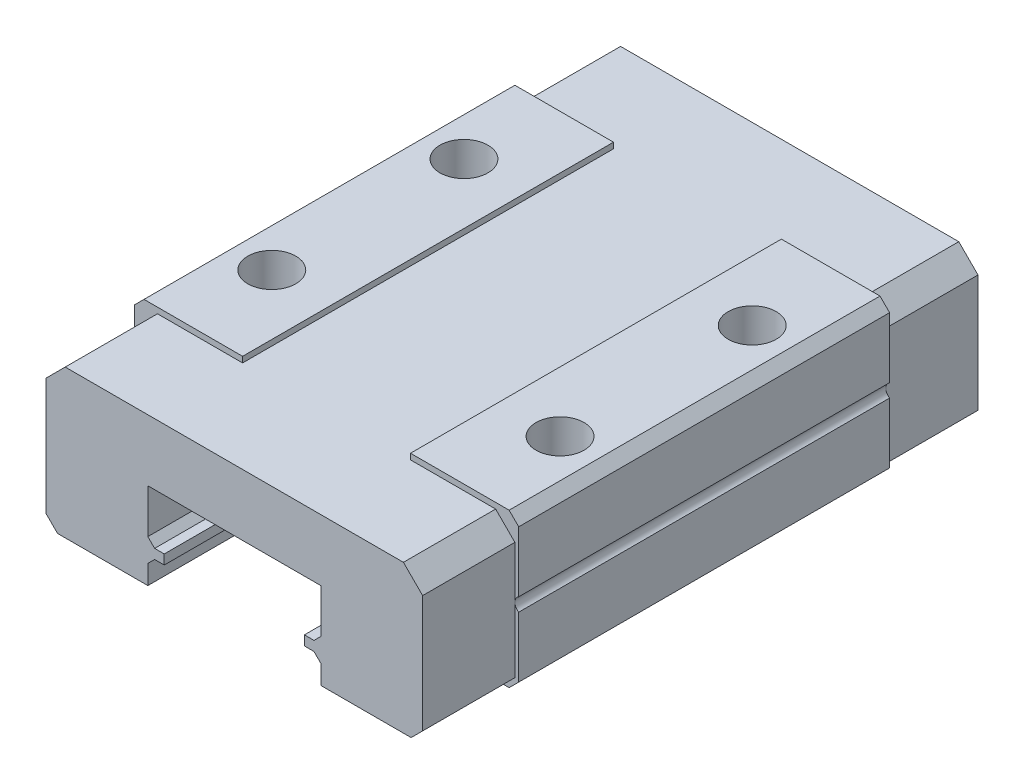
ISO-10303-21;
HEADER;
FILE_DESCRIPTION(('STEP AP214'),'2;1');
FILE_NAME('part.step','',(''),(''),'','','');
FILE_SCHEMA(('AUTOMOTIVE_DESIGN { 1 0 10303 214 1 1 1 1 }'));
ENDSEC;
DATA;
#1=APPLICATION_CONTEXT('core data for automotive mechanical design processes');
#2=APPLICATION_PROTOCOL_DEFINITION('international standard','automotive_design',2000,#1);
#3=PRODUCT_CONTEXT('',#1,'mechanical');
#4=PRODUCT('Part','Part','',(#3));
#5=PRODUCT_RELATED_PRODUCT_CATEGORY('part','',(#4));
#6=PRODUCT_DEFINITION_FORMATION('','',#4);
#7=PRODUCT_DEFINITION_CONTEXT('part definition',#1,'design');
#8=PRODUCT_DEFINITION('design','',#6,#7);
#9=PRODUCT_DEFINITION_SHAPE('','',#8);
#10=(LENGTH_UNIT() NAMED_UNIT(*) SI_UNIT(.MILLI.,.METRE.));
#11=(NAMED_UNIT(*) PLANE_ANGLE_UNIT() SI_UNIT($,.RADIAN.));
#12=(NAMED_UNIT(*) SI_UNIT($,.STERADIAN.) SOLID_ANGLE_UNIT());
#13=UNCERTAINTY_MEASURE_WITH_UNIT(LENGTH_MEASURE(1.E-05),#10,'distance_accuracy_value','');
#14=(GEOMETRIC_REPRESENTATION_CONTEXT(3) GLOBAL_UNCERTAINTY_ASSIGNED_CONTEXT((#13)) GLOBAL_UNIT_ASSIGNED_CONTEXT((#10,
#11,#12)) REPRESENTATION_CONTEXT('',''));
#15=CARTESIAN_POINT('',(0.,0.,0.));
#16=DIRECTION('',(0.,0.,1.));
#17=DIRECTION('',(1.,0.,0.));
#18=AXIS2_PLACEMENT_3D('',#15,#16,#17);
#19=CARTESIAN_POINT('',(10.,0.,-28.9));
#20=DIRECTION('',(1.,0.,0.));
#21=DIRECTION('',(0.,0.,-1.));
#22=AXIS2_PLACEMENT_3D('',#19,#20,#21);
#23=PLANE('',#22);
#24=DIRECTION('',(0.,0.,-1.));
#25=VECTOR('',#24,1.);
#26=CARTESIAN_POINT('',(10.,3.65358983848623,-3.66862915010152));
#27=LINE('',#26,#25);
#28=CARTESIAN_POINT('',(10.,3.65358983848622,-4.8));
#29=VERTEX_POINT('',#28);
#30=CARTESIAN_POINT('',(10.,3.65358983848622,-24.1));
#31=VERTEX_POINT('',#30);
#32=EDGE_CURVE('E51',#29,#31,#27,.T.);
#33=ORIENTED_EDGE('',*,*,#32,.F.);
#34=DIRECTION('',(0.,1.,0.));
#35=VECTOR('',#34,1.);
#36=CARTESIAN_POINT('',(10.,-0.6,-4.8));
#37=LINE('',#36,#35);
#38=CARTESIAN_POINT('',(10.,0.500000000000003,-4.8));
#39=VERTEX_POINT('',#38);
#40=EDGE_CURVE('E375',#39,#29,#37,.T.);
#41=ORIENTED_EDGE('',*,*,#40,.F.);
#42=DIRECTION('',(0.,0.,-1.));
#43=VECTOR('',#42,1.);
#44=CARTESIAN_POINT('',(10.,0.500000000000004,-28.9));
#45=LINE('',#44,#43);
#46=CARTESIAN_POINT('',(10.,0.500000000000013,-24.1));
#47=VERTEX_POINT('',#46);
#48=EDGE_CURVE('E737',#39,#47,#45,.T.);
#49=ORIENTED_EDGE('',*,*,#48,.T.);
#50=DIRECTION('',(0.,1.,0.));
#51=VECTOR('',#50,1.);
#52=CARTESIAN_POINT('',(10.,-0.6,-24.1));
#53=LINE('',#52,#51);
#54=EDGE_CURVE('E407',#47,#31,#53,.T.);
#55=ORIENTED_EDGE('',*,*,#54,.T.);
#56=EDGE_LOOP('',(#33,#41,#49,#55));
#57=FACE_BOUND('',#56,.T.);
#58=ADVANCED_FACE('F36',(#57),#23,.T.);
#59=CARTESIAN_POINT('',(4.36858101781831,7.7,-4.8));
#60=DIRECTION('',(0.,0.,-1.));
#61=DIRECTION('',(-1.,0.,0.));
#62=AXIS2_PLACEMENT_3D('',#59,#60,#61);
#63=PLANE('',#62);
#64=DIRECTION('',(0.,1.,0.));
#65=VECTOR('',#64,1.);
#66=CARTESIAN_POINT('',(9.8,-0.6,-4.8));
#67=LINE('',#66,#65);
#68=CARTESIAN_POINT('',(9.8,4.,-4.8));
#69=VERTEX_POINT('',#68);
#70=CARTESIAN_POINT('',(9.8,6.69999999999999,-4.8));
#71=VERTEX_POINT('',#70);
#72=EDGE_CURVE('E377',#69,#71,#67,.T.);
#73=ORIENTED_EDGE('',*,*,#72,.F.);
#74=CARTESIAN_POINT('',(10.2,4.,-4.8));
#75=DIRECTION('',(0.,0.,-1.));
#76=DIRECTION('',(-1.,0.,0.));
#77=AXIS2_PLACEMENT_3D('',#74,#75,#76);
#78=CIRCLE('',#77,0.4);
#79=CARTESIAN_POINT('',(10.,4.34641016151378,-4.8));
#80=VERTEX_POINT('',#79);
#81=EDGE_CURVE('E356',#80,#69,#78,.F.);
#82=ORIENTED_EDGE('',*,*,#81,.F.);
#83=CARTESIAN_POINT('',(10.,7.49999999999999,-4.8));
#84=VERTEX_POINT('',#83);
#85=EDGE_CURVE('E396',#80,#84,#37,.T.);
#86=ORIENTED_EDGE('',*,*,#85,.T.);
#87=DIRECTION('',(0.707106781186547,-0.707106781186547,0.));
#88=VECTOR('',#87,1.);
#89=CARTESIAN_POINT('',(10.,7.5,-4.80000000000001));
#90=LINE('',#89,#88);
#91=CARTESIAN_POINT('',(9.8,7.7,-4.8));
#92=VERTEX_POINT('',#91);
#93=EDGE_CURVE('E647',#84,#92,#90,.F.);
#94=ORIENTED_EDGE('',*,*,#93,.T.);
#95=DIRECTION('',(0.707106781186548,-0.707106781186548,0.));
#96=VECTOR('',#95,1.);
#97=CARTESIAN_POINT('',(10.,7.49999999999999,-4.8));
#98=LINE('',#97,#96);
#99=CARTESIAN_POINT('',(9.5,8.,-4.8));
#100=VERTEX_POINT('',#99);
#101=EDGE_CURVE('E640',#92,#100,#98,.F.);
#102=ORIENTED_EDGE('',*,*,#101,.T.);
#103=DIRECTION('',(-1.,0.,0.));
#104=VECTOR('',#103,1.);
#105=CARTESIAN_POINT('',(4.36858101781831,8.,-4.8));
#106=LINE('',#105,#104);
#107=CARTESIAN_POINT('',(4.36858101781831,8.,-4.8));
#108=VERTEX_POINT('',#107);
#109=EDGE_CURVE('E448',#100,#108,#106,.T.);
#110=ORIENTED_EDGE('',*,*,#109,.T.);
#111=DIRECTION('',(0.,1.,0.));
#112=VECTOR('',#111,1.);
#113=CARTESIAN_POINT('',(4.36858101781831,7.7,-4.8));
#114=LINE('',#113,#112);
#115=CARTESIAN_POINT('',(4.36858101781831,7.7,-4.8));
#116=VERTEX_POINT('',#115);
#117=EDGE_CURVE('E457',#116,#108,#114,.T.);
#118=ORIENTED_EDGE('',*,*,#117,.F.);
#119=DIRECTION('',(-1.,0.,0.));
#120=VECTOR('',#119,1.);
#121=CARTESIAN_POINT('',(9.5,7.7,-4.8));
#122=LINE('',#121,#120);
#123=CARTESIAN_POINT('',(8.79999999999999,7.7,-4.8));
#124=VERTEX_POINT('',#123);
#125=EDGE_CURVE('E431',#124,#116,#122,.T.);
#126=ORIENTED_EDGE('',*,*,#125,.F.);
#127=DIRECTION('',(-0.707106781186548,0.707106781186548,0.));
#128=VECTOR('',#127,1.);
#129=CARTESIAN_POINT('',(6.58429050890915,9.91570949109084,-4.8));
#130=LINE('',#129,#128);
#131=EDGE_CURVE('E380',#124,#71,#130,.F.);
#132=ORIENTED_EDGE('',*,*,#131,.T.);
#133=EDGE_LOOP('',(#73,#82,#86,#94,#102,#110,#118,#126,#132));
#134=FACE_BOUND('',#133,.T.);
#135=ADVANCED_FACE('F378',(#134),#63,.F.);
#136=CARTESIAN_POINT('',(9.8,-0.6,-24.1));
#137=DIRECTION('',(0.,0.,1.));
#138=DIRECTION('',(1.,0.,0.));
#139=AXIS2_PLACEMENT_3D('',#136,#137,#138);
#140=PLANE('',#139);
#141=CARTESIAN_POINT('',(10.,4.34641016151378,-24.1));
#142=VERTEX_POINT('',#141);
#143=CARTESIAN_POINT('',(10.,7.49999999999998,-24.1));
#144=VERTEX_POINT('',#143);
#145=EDGE_CURVE('E399',#142,#144,#53,.T.);
#146=ORIENTED_EDGE('',*,*,#145,.F.);
#147=CARTESIAN_POINT('',(10.2,4.,-24.1));
#148=DIRECTION('',(0.,0.,-1.));
#149=DIRECTION('',(-1.,0.,0.));
#150=AXIS2_PLACEMENT_3D('',#147,#148,#149);
#151=CIRCLE('',#150,0.4);
#152=CARTESIAN_POINT('',(9.8,4.,-24.1));
#153=VERTEX_POINT('',#152);
#154=EDGE_CURVE('E365',#153,#142,#151,.T.);
#155=ORIENTED_EDGE('',*,*,#154,.F.);
#156=DIRECTION('',(0.,1.,0.));
#157=VECTOR('',#156,1.);
#158=CARTESIAN_POINT('',(9.8,-0.6,-24.1));
#159=LINE('',#158,#157);
#160=CARTESIAN_POINT('',(9.8,6.69999999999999,-24.1));
#161=VERTEX_POINT('',#160);
#162=EDGE_CURVE('E404',#153,#161,#159,.T.);
#163=ORIENTED_EDGE('',*,*,#162,.T.);
#164=DIRECTION('',(0.707106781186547,-0.707106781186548,0.));
#165=VECTOR('',#164,1.);
#166=CARTESIAN_POINT('',(13.45,3.04999999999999,-24.1));
#167=LINE('',#166,#165);
#168=CARTESIAN_POINT('',(8.79999999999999,7.7,-24.1));
#169=VERTEX_POINT('',#168);
#170=EDGE_CURVE('E688',#161,#169,#167,.F.);
#171=ORIENTED_EDGE('',*,*,#170,.T.);
#172=DIRECTION('',(1.,0.,0.));
#173=VECTOR('',#172,1.);
#174=CARTESIAN_POINT('',(9.49999999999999,7.7,-24.1));
#175=LINE('',#174,#173);
#176=CARTESIAN_POINT('',(4.36858101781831,7.7,-24.1));
#177=VERTEX_POINT('',#176);
#178=EDGE_CURVE('E436',#177,#169,#175,.T.);
#179=ORIENTED_EDGE('',*,*,#178,.F.);
#180=DIRECTION('',(0.,1.,0.));
#181=VECTOR('',#180,1.);
#182=CARTESIAN_POINT('',(4.36858101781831,7.7,-24.1));
#183=LINE('',#182,#181);
#184=CARTESIAN_POINT('',(4.36858101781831,8.,-24.1));
#185=VERTEX_POINT('',#184);
#186=EDGE_CURVE('E454',#177,#185,#183,.T.);
#187=ORIENTED_EDGE('',*,*,#186,.T.);
#188=DIRECTION('',(1.,0.,0.));
#189=VECTOR('',#188,1.);
#190=CARTESIAN_POINT('',(10.,8.,-24.1));
#191=LINE('',#190,#189);
#192=CARTESIAN_POINT('',(9.5,8.,-24.1));
#193=VERTEX_POINT('',#192);
#194=EDGE_CURVE('E423',#185,#193,#191,.T.);
#195=ORIENTED_EDGE('',*,*,#194,.T.);
#196=DIRECTION('',(-0.707106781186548,0.707106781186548,0.));
#197=VECTOR('',#196,1.);
#198=CARTESIAN_POINT('',(10.,7.5,-24.1));
#199=LINE('',#198,#197);
#200=CARTESIAN_POINT('',(9.8,7.7,-24.1));
#201=VERTEX_POINT('',#200);
#202=EDGE_CURVE('E637',#193,#201,#199,.F.);
#203=ORIENTED_EDGE('',*,*,#202,.T.);
#204=DIRECTION('',(-0.707106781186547,0.707106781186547,0.));
#205=VECTOR('',#204,1.);
#206=CARTESIAN_POINT('',(10.,7.5,-24.1));
#207=LINE('',#206,#205);
#208=EDGE_CURVE('E644',#201,#144,#207,.F.);
#209=ORIENTED_EDGE('',*,*,#208,.T.);
#210=EDGE_LOOP('',(#146,#155,#163,#171,#179,#187,#195,#203,#209));
#211=FACE_BOUND('',#210,.T.);
#212=ADVANCED_FACE('F834',(#211),#140,.F.);
#213=CARTESIAN_POINT('',(10.,8.,-28.9));
#214=DIRECTION('',(0.,1.,0.));
#215=DIRECTION('',(0.,0.,1.));
#216=AXIS2_PLACEMENT_3D('',#213,#214,#215);
#217=PLANE('',#216);
#218=ORIENTED_EDGE('',*,*,#194,.F.);
#219=DIRECTION('',(0.,0.,-1.));
#220=VECTOR('',#219,1.);
#221=CARTESIAN_POINT('',(4.36858101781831,8.,-24.1));
#222=LINE('',#221,#220);
#223=EDGE_CURVE('E450',#108,#185,#222,.T.);
#224=ORIENTED_EDGE('',*,*,#223,.F.);
#225=ORIENTED_EDGE('',*,*,#109,.F.);
#226=DIRECTION('',(0.,0.,-1.));
#227=VECTOR('',#226,1.);
#228=CARTESIAN_POINT('',(9.5,8.,-28.9));
#229=LINE('',#228,#227);
#230=EDGE_CURVE('E626',#100,#193,#229,.T.);
#231=ORIENTED_EDGE('',*,*,#230,.T.);
#232=EDGE_LOOP('',(#218,#224,#225,#231));
#233=FACE_BOUND('',#232,.T.);
#234=CARTESIAN_POINT('',(7.5,8.,-19.45));
#235=DIRECTION('',(0.,1.,0.));
#236=DIRECTION('',(0.,0.,1.));
#237=AXIS2_PLACEMENT_3D('',#234,#235,#236);
#238=CIRCLE('',#237,1.24999999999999);
#239=CARTESIAN_POINT('',(7.5,8.,-18.2));
#240=VERTEX_POINT('',#239);
#241=EDGE_CURVE('E481',#240,#240,#238,.T.);
#242=ORIENTED_EDGE('',*,*,#241,.F.);
#243=EDGE_LOOP('',(#242));
#244=FACE_BOUND('',#243,.T.);
#245=CARTESIAN_POINT('',(7.5,8.,-9.45));
#246=DIRECTION('',(0.,1.,0.));
#247=DIRECTION('',(0.,0.,1.));
#248=AXIS2_PLACEMENT_3D('',#245,#246,#247);
#249=CIRCLE('',#248,1.24999999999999);
#250=CARTESIAN_POINT('',(7.5,8.,-8.20000000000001));
#251=VERTEX_POINT('',#250);
#252=EDGE_CURVE('E475',#251,#251,#249,.T.);
#253=ORIENTED_EDGE('',*,*,#252,.F.);
#254=EDGE_LOOP('',(#253));
#255=FACE_BOUND('',#254,.T.);
#256=ADVANCED_FACE('F861',(#233,#244,#255),#217,.T.);
#257=DIRECTION('',(-1.,0.,0.));
#258=VECTOR('',#257,1.);
#259=CARTESIAN_POINT('',(-10.,8.,-4.8));
#260=LINE('',#259,#258);
#261=CARTESIAN_POINT('',(-4.36858101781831,8.,-4.8));
#262=VERTEX_POINT('',#261);
#263=CARTESIAN_POINT('',(-9.5,8.,-4.8));
#264=VERTEX_POINT('',#263);
#265=EDGE_CURVE('E446',#262,#264,#260,.T.);
#266=ORIENTED_EDGE('',*,*,#265,.F.);
#267=DIRECTION('',(0.,0.,1.));
#268=VECTOR('',#267,1.);
#269=CARTESIAN_POINT('',(-4.36858101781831,8.,-24.1));
#270=LINE('',#269,#268);
#271=CARTESIAN_POINT('',(-4.36858101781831,8.,-24.1));
#272=VERTEX_POINT('',#271);
#273=EDGE_CURVE('E443',#272,#262,#270,.T.);
#274=ORIENTED_EDGE('',*,*,#273,.F.);
#275=DIRECTION('',(1.,0.,0.));
#276=VECTOR('',#275,1.);
#277=CARTESIAN_POINT('',(-9.49999999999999,8.,-24.1));
#278=LINE('',#277,#276);
#279=CARTESIAN_POINT('',(-9.5,8.,-24.1));
#280=VERTEX_POINT('',#279);
#281=EDGE_CURVE('E419',#280,#272,#278,.T.);
#282=ORIENTED_EDGE('',*,*,#281,.F.);
#283=DIRECTION('',(0.,0.,1.));
#284=VECTOR('',#283,1.);
#285=CARTESIAN_POINT('',(-9.5,8.,-28.9));
#286=LINE('',#285,#284);
#287=EDGE_CURVE('E623',#280,#264,#286,.T.);
#288=ORIENTED_EDGE('',*,*,#287,.T.);
#289=EDGE_LOOP('',(#266,#274,#282,#288));
#290=FACE_BOUND('',#289,.T.);
#291=CARTESIAN_POINT('',(-7.5,8.,-19.45));
#292=DIRECTION('',(0.,1.,0.));
#293=DIRECTION('',(0.,0.,1.));
#294=AXIS2_PLACEMENT_3D('',#291,#292,#293);
#295=CIRCLE('',#294,1.24999999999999);
#296=CARTESIAN_POINT('',(-7.5,8.,-18.2));
#297=VERTEX_POINT('',#296);
#298=EDGE_CURVE('E456',#297,#297,#295,.T.);
#299=ORIENTED_EDGE('',*,*,#298,.F.);
#300=EDGE_LOOP('',(#299));
#301=FACE_BOUND('',#300,.T.);
#302=CARTESIAN_POINT('',(-7.5,8.,-9.45));
#303=DIRECTION('',(0.,1.,0.));
#304=DIRECTION('',(0.,0.,1.));
#305=AXIS2_PLACEMENT_3D('',#302,#303,#304);
#306=CIRCLE('',#305,1.24999999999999);
#307=CARTESIAN_POINT('',(-7.5,8.,-8.20000000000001));
#308=VERTEX_POINT('',#307);
#309=EDGE_CURVE('E469',#308,#308,#306,.T.);
#310=ORIENTED_EDGE('',*,*,#309,.F.);
#311=EDGE_LOOP('',(#310));
#312=FACE_BOUND('',#311,.T.);
#313=ADVANCED_FACE('F774',(#290,#301,#312),#217,.T.);
#314=DIRECTION('',(0.,0.,-1.));
#315=VECTOR('',#314,1.);
#316=CARTESIAN_POINT('',(10.,4.34641016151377,-3.66862915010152));
#317=LINE('',#316,#315);
#318=EDGE_CURVE('E361',#142,#80,#317,.F.);
#319=ORIENTED_EDGE('',*,*,#318,.F.);
#320=ORIENTED_EDGE('',*,*,#145,.T.);
#321=DIRECTION('',(0.,0.,1.));
#322=VECTOR('',#321,1.);
#323=CARTESIAN_POINT('',(10.,7.5,-28.9));
#324=LINE('',#323,#322);
#325=EDGE_CURVE('E590',#144,#84,#324,.T.);
#326=ORIENTED_EDGE('',*,*,#325,.T.);
#327=ORIENTED_EDGE('',*,*,#85,.F.);
#328=EDGE_LOOP('',(#319,#320,#326,#327));
#329=FACE_BOUND('',#328,.T.);
#330=ADVANCED_FACE('F871',(#329),#23,.T.);
#331=CARTESIAN_POINT('',(4.5,0.,-28.9));
#332=DIRECTION('',(0.,-1.,0.));
#333=DIRECTION('',(0.,0.,-1.));
#334=AXIS2_PLACEMENT_3D('',#331,#332,#333);
#335=PLANE('',#334);
#336=DIRECTION('',(-1.,0.,0.));
#337=VECTOR('',#336,1.);
#338=CARTESIAN_POINT('',(4.5,0.,-24.1));
#339=LINE('',#338,#337);
#340=CARTESIAN_POINT('',(9.5,0.,-24.1));
#341=VERTEX_POINT('',#340);
#342=CARTESIAN_POINT('',(9.2,0.,-24.1));
#343=VERTEX_POINT('',#342);
#344=EDGE_CURVE('E403',#341,#343,#339,.T.);
#345=ORIENTED_EDGE('',*,*,#344,.F.);
#346=DIRECTION('',(0.,0.,1.));
#347=VECTOR('',#346,1.);
#348=CARTESIAN_POINT('',(9.5,0.,-28.9));
#349=LINE('',#348,#347);
#350=CARTESIAN_POINT('',(9.49999999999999,0.,-4.8));
#351=VERTEX_POINT('',#350);
#352=EDGE_CURVE('E732',#341,#351,#349,.T.);
#353=ORIENTED_EDGE('',*,*,#352,.T.);
#354=DIRECTION('',(1.,0.,0.));
#355=VECTOR('',#354,1.);
#356=CARTESIAN_POINT('',(4.5,0.,-4.8));
#357=LINE('',#356,#355);
#358=CARTESIAN_POINT('',(9.2,0.,-4.8));
#359=VERTEX_POINT('',#358);
#360=EDGE_CURVE('E391',#359,#351,#357,.T.);
#361=ORIENTED_EDGE('',*,*,#360,.F.);
#362=DIRECTION('',(0.,0.,1.));
#363=VECTOR('',#362,1.);
#364=CARTESIAN_POINT('',(9.2,0.,0.));
#365=LINE('',#364,#363);
#366=CARTESIAN_POINT('',(9.2,0.,0.));
#367=VERTEX_POINT('',#366);
#368=EDGE_CURVE('E699',#359,#367,#365,.T.);
#369=ORIENTED_EDGE('',*,*,#368,.T.);
#370=DIRECTION('',(1.,0.,0.));
#371=VECTOR('',#370,1.);
#372=CARTESIAN_POINT('',(4.5,0.,0.));
#373=LINE('',#372,#371);
#374=CARTESIAN_POINT('',(4.5,0.,0.));
#375=VERTEX_POINT('',#374);
#376=EDGE_CURVE('E491',#375,#367,#373,.T.);
#377=ORIENTED_EDGE('',*,*,#376,.F.);
#378=DIRECTION('',(0.,0.,1.));
#379=VECTOR('',#378,1.);
#380=CARTESIAN_POINT('',(4.5,0.,-28.9));
#381=LINE('',#380,#379);
#382=CARTESIAN_POINT('',(4.5,0.,-28.9));
#383=VERTEX_POINT('',#382);
#384=EDGE_CURVE('E588',#383,#375,#381,.T.);
#385=ORIENTED_EDGE('',*,*,#384,.F.);
#386=DIRECTION('',(1.,0.,0.));
#387=VECTOR('',#386,1.);
#388=CARTESIAN_POINT('',(4.5,0.,-28.9));
#389=LINE('',#388,#387);
#390=CARTESIAN_POINT('',(9.2,0.,-28.9));
#391=VERTEX_POINT('',#390);
#392=EDGE_CURVE('E536',#383,#391,#389,.T.);
#393=ORIENTED_EDGE('',*,*,#392,.T.);
#394=DIRECTION('',(0.,0.,1.));
#395=VECTOR('',#394,1.);
#396=CARTESIAN_POINT('',(9.2,0.,-24.1));
#397=LINE('',#396,#395);
#398=EDGE_CURVE('E696',#391,#343,#397,.T.);
#399=ORIENTED_EDGE('',*,*,#398,.T.);
#400=EDGE_LOOP('',(#345,#353,#361,#369,#377,#385,#393,#399));
#401=FACE_BOUND('',#400,.T.);
#402=ADVANCED_FACE('F873',(#401),#335,.T.);
#403=CARTESIAN_POINT('',(4.5,0.,-28.9));
#404=DIRECTION('',(-1.,0.,0.));
#405=DIRECTION('',(0.,-1.,0.));
#406=AXIS2_PLACEMENT_3D('',#403,#404,#405);
#407=PLANE('',#406);
#408=DIRECTION('',(0.,-1.,0.));
#409=VECTOR('',#408,1.);
#410=CARTESIAN_POINT('',(4.5,0.,0.));
#411=LINE('',#410,#409);
#412=CARTESIAN_POINT('',(4.5,1.,0.));
#413=VERTEX_POINT('',#412);
#414=EDGE_CURVE('E583',#413,#375,#411,.T.);
#415=ORIENTED_EDGE('',*,*,#414,.F.);
#416=DIRECTION('',(0.,0.,1.));
#417=VECTOR('',#416,1.);
#418=CARTESIAN_POINT('',(4.5,1.,-28.9));
#419=LINE('',#418,#417);
#420=CARTESIAN_POINT('',(4.5,1.,-28.9));
#421=VERTEX_POINT('',#420);
#422=EDGE_CURVE('E591',#421,#413,#419,.T.);
#423=ORIENTED_EDGE('',*,*,#422,.F.);
#424=DIRECTION('',(0.,-1.,0.));
#425=VECTOR('',#424,1.);
#426=CARTESIAN_POINT('',(4.5,0.,-28.9));
#427=LINE('',#426,#425);
#428=EDGE_CURVE('E533',#421,#383,#427,.T.);
#429=ORIENTED_EDGE('',*,*,#428,.T.);
#430=ORIENTED_EDGE('',*,*,#384,.T.);
#431=EDGE_LOOP('',(#415,#423,#429,#430));
#432=FACE_BOUND('',#431,.T.);
#433=ADVANCED_FACE('F879',(#432),#407,.T.);
#434=CARTESIAN_POINT('',(4.5,1.,-28.9));
#435=DIRECTION('',(-0.707106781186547,-0.707106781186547,0.));
#436=DIRECTION('',(0.707106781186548,-0.707106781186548,0.));
#437=AXIS2_PLACEMENT_3D('',#434,#435,#436);
#438=PLANE('',#437);
#439=DIRECTION('',(0.707106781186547,-0.707106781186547,0.));
#440=VECTOR('',#439,1.);
#441=CARTESIAN_POINT('',(4.5,1.,0.));
#442=LINE('',#441,#440);
#443=CARTESIAN_POINT('',(4.14644660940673,1.35355339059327,0.));
#444=VERTEX_POINT('',#443);
#445=EDGE_CURVE('E580',#444,#413,#442,.T.);
#446=ORIENTED_EDGE('',*,*,#445,.F.);
#447=DIRECTION('',(0.,0.,1.));
#448=VECTOR('',#447,1.);
#449=CARTESIAN_POINT('',(4.14644660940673,1.35355339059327,-28.9));
#450=LINE('',#449,#448);
#451=CARTESIAN_POINT('',(4.14644660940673,1.35355339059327,-28.9));
#452=VERTEX_POINT('',#451);
#453=EDGE_CURVE('E593',#452,#444,#450,.T.);
#454=ORIENTED_EDGE('',*,*,#453,.F.);
#455=DIRECTION('',(0.707106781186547,-0.707106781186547,0.));
#456=VECTOR('',#455,1.);
#457=CARTESIAN_POINT('',(4.5,1.,-28.9));
#458=LINE('',#457,#456);
#459=EDGE_CURVE('E530',#452,#421,#458,.T.);
#460=ORIENTED_EDGE('',*,*,#459,.T.);
#461=ORIENTED_EDGE('',*,*,#422,.T.);
#462=EDGE_LOOP('',(#446,#454,#460,#461));
#463=FACE_BOUND('',#462,.T.);
#464=ADVANCED_FACE('F908',(#463),#438,.T.);
#465=CARTESIAN_POINT('',(4.14644660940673,1.35355339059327,-28.9));
#466=DIRECTION('',(0.,-1.,0.));
#467=DIRECTION('',(1.,0.,0.));
#468=AXIS2_PLACEMENT_3D('',#465,#466,#467);
#469=PLANE('',#468);
#470=DIRECTION('',(1.,0.,0.));
#471=VECTOR('',#470,1.);
#472=CARTESIAN_POINT('',(4.14644660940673,1.35355339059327,0.));
#473=LINE('',#472,#471);
#474=CARTESIAN_POINT('',(3.64644660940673,1.35355339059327,0.));
#475=VERTEX_POINT('',#474);
#476=EDGE_CURVE('E577',#475,#444,#473,.T.);
#477=ORIENTED_EDGE('',*,*,#476,.F.);
#478=DIRECTION('',(0.,0.,1.));
#479=VECTOR('',#478,1.);
#480=CARTESIAN_POINT('',(3.64644660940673,1.35355339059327,-28.9));
#481=LINE('',#480,#479);
#482=CARTESIAN_POINT('',(3.64644660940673,1.35355339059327,-28.9));
#483=VERTEX_POINT('',#482);
#484=EDGE_CURVE('E595',#483,#475,#481,.T.);
#485=ORIENTED_EDGE('',*,*,#484,.F.);
#486=DIRECTION('',(1.,0.,0.));
#487=VECTOR('',#486,1.);
#488=CARTESIAN_POINT('',(4.14644660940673,1.35355339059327,-28.9));
#489=LINE('',#488,#487);
#490=EDGE_CURVE('E527',#483,#452,#489,.T.);
#491=ORIENTED_EDGE('',*,*,#490,.T.);
#492=ORIENTED_EDGE('',*,*,#453,.T.);
#493=EDGE_LOOP('',(#477,#485,#491,#492));
#494=FACE_BOUND('',#493,.T.);
#495=ADVANCED_FACE('F911',(#494),#469,.T.);
#496=CARTESIAN_POINT('',(3.64644660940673,1.35355339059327,-28.9));
#497=DIRECTION('',(-1.,0.,0.));
#498=DIRECTION('',(0.,0.,1.));
#499=AXIS2_PLACEMENT_3D('',#496,#497,#498);
#500=PLANE('',#499);
#501=DIRECTION('',(0.,-1.,0.));
#502=VECTOR('',#501,1.);
#503=CARTESIAN_POINT('',(3.64644660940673,1.35355339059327,0.));
#504=LINE('',#503,#502);
#505=CARTESIAN_POINT('',(3.64644660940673,1.85355339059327,0.));
#506=VERTEX_POINT('',#505);
#507=EDGE_CURVE('E574',#506,#475,#504,.T.);
#508=ORIENTED_EDGE('',*,*,#507,.F.);
#509=DIRECTION('',(0.,0.,1.));
#510=VECTOR('',#509,1.);
#511=CARTESIAN_POINT('',(3.64644660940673,1.85355339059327,-28.9));
#512=LINE('',#511,#510);
#513=CARTESIAN_POINT('',(3.64644660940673,1.85355339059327,-28.9));
#514=VERTEX_POINT('',#513);
#515=EDGE_CURVE('E597',#514,#506,#512,.T.);
#516=ORIENTED_EDGE('',*,*,#515,.F.);
#517=DIRECTION('',(0.,-1.,0.));
#518=VECTOR('',#517,1.);
#519=CARTESIAN_POINT('',(3.64644660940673,1.35355339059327,-28.9));
#520=LINE('',#519,#518);
#521=EDGE_CURVE('E524',#514,#483,#520,.T.);
#522=ORIENTED_EDGE('',*,*,#521,.T.);
#523=ORIENTED_EDGE('',*,*,#484,.T.);
#524=EDGE_LOOP('',(#508,#516,#522,#523));
#525=FACE_BOUND('',#524,.T.);
#526=ADVANCED_FACE('F916',(#525),#500,.T.);
#527=CARTESIAN_POINT('',(3.64644660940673,1.85355339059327,-28.9));
#528=DIRECTION('',(0.,1.,0.));
#529=DIRECTION('',(0.,0.,1.));
#530=AXIS2_PLACEMENT_3D('',#527,#528,#529);
#531=PLANE('',#530);
#532=DIRECTION('',(-1.,0.,0.));
#533=VECTOR('',#532,1.);
#534=CARTESIAN_POINT('',(3.64644660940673,1.85355339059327,0.));
#535=LINE('',#534,#533);
#536=CARTESIAN_POINT('',(4.14644660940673,1.85355339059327,0.));
#537=VERTEX_POINT('',#536);
#538=EDGE_CURVE('E571',#537,#506,#535,.T.);
#539=ORIENTED_EDGE('',*,*,#538,.F.);
#540=DIRECTION('',(0.,0.,1.));
#541=VECTOR('',#540,1.);
#542=CARTESIAN_POINT('',(4.14644660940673,1.85355339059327,-28.9));
#543=LINE('',#542,#541);
#544=CARTESIAN_POINT('',(4.14644660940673,1.85355339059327,-28.9));
#545=VERTEX_POINT('',#544);
#546=EDGE_CURVE('E599',#545,#537,#543,.T.);
#547=ORIENTED_EDGE('',*,*,#546,.F.);
#548=DIRECTION('',(-1.,0.,0.));
#549=VECTOR('',#548,1.);
#550=CARTESIAN_POINT('',(3.64644660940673,1.85355339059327,-28.9));
#551=LINE('',#550,#549);
#552=EDGE_CURVE('E521',#545,#514,#551,.T.);
#553=ORIENTED_EDGE('',*,*,#552,.T.);
#554=ORIENTED_EDGE('',*,*,#515,.T.);
#555=EDGE_LOOP('',(#539,#547,#553,#554));
#556=FACE_BOUND('',#555,.T.);
#557=ADVANCED_FACE('F919',(#556),#531,.T.);
#558=CARTESIAN_POINT('',(4.14644660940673,1.85355339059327,-28.9));
#559=DIRECTION('',(-0.707106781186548,0.707106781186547,0.));
#560=DIRECTION('',(-0.707106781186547,-0.707106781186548,0.));
#561=AXIS2_PLACEMENT_3D('',#558,#559,#560);
#562=PLANE('',#561);
#563=DIRECTION('',(-0.707106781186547,-0.707106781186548,0.));
#564=VECTOR('',#563,1.);
#565=CARTESIAN_POINT('',(4.14644660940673,1.85355339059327,0.));
#566=LINE('',#565,#564);
#567=CARTESIAN_POINT('',(4.5,2.20710678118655,0.));
#568=VERTEX_POINT('',#567);
#569=EDGE_CURVE('E568',#568,#537,#566,.T.);
#570=ORIENTED_EDGE('',*,*,#569,.F.);
#571=DIRECTION('',(0.,0.,1.));
#572=VECTOR('',#571,1.);
#573=CARTESIAN_POINT('',(4.5,2.20710678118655,-28.9));
#574=LINE('',#573,#572);
#575=CARTESIAN_POINT('',(4.5,2.20710678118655,-28.9));
#576=VERTEX_POINT('',#575);
#577=EDGE_CURVE('E601',#576,#568,#574,.T.);
#578=ORIENTED_EDGE('',*,*,#577,.F.);
#579=DIRECTION('',(-0.707106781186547,-0.707106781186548,0.));
#580=VECTOR('',#579,1.);
#581=CARTESIAN_POINT('',(4.14644660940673,1.85355339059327,-28.9));
#582=LINE('',#581,#580);
#583=EDGE_CURVE('E518',#576,#545,#582,.T.);
#584=ORIENTED_EDGE('',*,*,#583,.T.);
#585=ORIENTED_EDGE('',*,*,#546,.T.);
#586=EDGE_LOOP('',(#570,#578,#584,#585));
#587=FACE_BOUND('',#586,.T.);
#588=ADVANCED_FACE('F924',(#587),#562,.T.);
#589=CARTESIAN_POINT('',(4.5,2.20710678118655,-28.9));
#590=DIRECTION('',(-1.,0.,0.));
#591=DIRECTION('',(0.,0.,1.));
#592=AXIS2_PLACEMENT_3D('',#589,#590,#591);
#593=PLANE('',#592);
#594=DIRECTION('',(0.,-1.,0.));
#595=VECTOR('',#594,1.);
#596=CARTESIAN_POINT('',(4.5,2.20710678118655,0.));
#597=LINE('',#596,#595);
#598=CARTESIAN_POINT('',(4.5,4.5,0.));
#599=VERTEX_POINT('',#598);
#600=EDGE_CURVE('E565',#599,#568,#597,.T.);
#601=ORIENTED_EDGE('',*,*,#600,.F.);
#602=DIRECTION('',(0.,0.,1.));
#603=VECTOR('',#602,1.);
#604=CARTESIAN_POINT('',(4.5,4.5,-28.9));
#605=LINE('',#604,#603);
#606=CARTESIAN_POINT('',(4.5,4.5,-28.9));
#607=VERTEX_POINT('',#606);
#608=EDGE_CURVE('E603',#607,#599,#605,.T.);
#609=ORIENTED_EDGE('',*,*,#608,.F.);
#610=DIRECTION('',(0.,-1.,0.));
#611=VECTOR('',#610,1.);
#612=CARTESIAN_POINT('',(4.5,2.20710678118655,-28.9));
#613=LINE('',#612,#611);
#614=EDGE_CURVE('E515',#607,#576,#613,.T.);
#615=ORIENTED_EDGE('',*,*,#614,.T.);
#616=ORIENTED_EDGE('',*,*,#577,.T.);
#617=EDGE_LOOP('',(#601,#609,#615,#616));
#618=FACE_BOUND('',#617,.T.);
#619=ADVANCED_FACE('F927',(#618),#593,.T.);
#620=CARTESIAN_POINT('',(4.5,4.5,-28.9));
#621=DIRECTION('',(0.,-1.,0.));
#622=DIRECTION('',(0.,0.,-1.));
#623=AXIS2_PLACEMENT_3D('',#620,#621,#622);
#624=PLANE('',#623);
#625=DIRECTION('',(1.,0.,0.));
#626=VECTOR('',#625,1.);
#627=CARTESIAN_POINT('',(4.5,4.5,0.));
#628=LINE('',#627,#626);
#629=CARTESIAN_POINT('',(-4.5,4.5,0.));
#630=VERTEX_POINT('',#629);
#631=EDGE_CURVE('E562',#630,#599,#628,.T.);
#632=ORIENTED_EDGE('',*,*,#631,.F.);
#633=DIRECTION('',(0.,0.,1.));
#634=VECTOR('',#633,1.);
#635=CARTESIAN_POINT('',(-4.5,4.5,-28.9));
#636=LINE('',#635,#634);
#637=CARTESIAN_POINT('',(-4.5,4.5,-28.9));
#638=VERTEX_POINT('',#637);
#639=EDGE_CURVE('E605',#638,#630,#636,.T.);
#640=ORIENTED_EDGE('',*,*,#639,.F.);
#641=DIRECTION('',(1.,0.,0.));
#642=VECTOR('',#641,1.);
#643=CARTESIAN_POINT('',(4.5,4.5,-28.9));
#644=LINE('',#643,#642);
#645=EDGE_CURVE('E512',#638,#607,#644,.T.);
#646=ORIENTED_EDGE('',*,*,#645,.T.);
#647=ORIENTED_EDGE('',*,*,#608,.T.);
#648=EDGE_LOOP('',(#632,#640,#646,#647));
#649=FACE_BOUND('',#648,.T.);
#650=ADVANCED_FACE('F932',(#649),#624,.T.);
#651=CARTESIAN_POINT('',(-4.5,2.20710678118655,-28.9));
#652=DIRECTION('',(1.,0.,0.));
#653=DIRECTION('',(0.,0.,-1.));
#654=AXIS2_PLACEMENT_3D('',#651,#652,#653);
#655=PLANE('',#654);
#656=DIRECTION('',(0.,1.,0.));
#657=VECTOR('',#656,1.);
#658=CARTESIAN_POINT('',(-4.5,2.20710678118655,0.));
#659=LINE('',#658,#657);
#660=CARTESIAN_POINT('',(-4.5,2.20710678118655,0.));
#661=VERTEX_POINT('',#660);
#662=EDGE_CURVE('E559',#661,#630,#659,.T.);
#663=ORIENTED_EDGE('',*,*,#662,.F.);
#664=DIRECTION('',(0.,0.,1.));
#665=VECTOR('',#664,1.);
#666=CARTESIAN_POINT('',(-4.5,2.20710678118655,-28.9));
#667=LINE('',#666,#665);
#668=CARTESIAN_POINT('',(-4.5,2.20710678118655,-28.9));
#669=VERTEX_POINT('',#668);
#670=EDGE_CURVE('E607',#669,#661,#667,.T.);
#671=ORIENTED_EDGE('',*,*,#670,.F.);
#672=DIRECTION('',(0.,1.,0.));
#673=VECTOR('',#672,1.);
#674=CARTESIAN_POINT('',(-4.5,2.20710678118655,-28.9));
#675=LINE('',#674,#673);
#676=EDGE_CURVE('E509',#669,#638,#675,.T.);
#677=ORIENTED_EDGE('',*,*,#676,.T.);
#678=ORIENTED_EDGE('',*,*,#639,.T.);
#679=EDGE_LOOP('',(#663,#671,#677,#678));
#680=FACE_BOUND('',#679,.T.);
#681=ADVANCED_FACE('F935',(#680),#655,.T.);
#682=CARTESIAN_POINT('',(-4.14644660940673,1.85355339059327,-28.9));
#683=DIRECTION('',(0.707106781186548,0.707106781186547,0.));
#684=DIRECTION('',(-0.707106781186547,0.707106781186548,0.));
#685=AXIS2_PLACEMENT_3D('',#682,#683,#684);
#686=PLANE('',#685);
#687=DIRECTION('',(-0.707106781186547,0.707106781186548,0.));
#688=VECTOR('',#687,1.);
#689=CARTESIAN_POINT('',(-4.14644660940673,1.85355339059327,0.));
#690=LINE('',#689,#688);
#691=CARTESIAN_POINT('',(-4.14644660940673,1.85355339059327,0.));
#692=VERTEX_POINT('',#691);
#693=EDGE_CURVE('E556',#692,#661,#690,.T.);
#694=ORIENTED_EDGE('',*,*,#693,.F.);
#695=DIRECTION('',(0.,0.,1.));
#696=VECTOR('',#695,1.);
#697=CARTESIAN_POINT('',(-4.14644660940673,1.85355339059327,-28.9));
#698=LINE('',#697,#696);
#699=CARTESIAN_POINT('',(-4.14644660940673,1.85355339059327,-28.9));
#700=VERTEX_POINT('',#699);
#701=EDGE_CURVE('E609',#700,#692,#698,.T.);
#702=ORIENTED_EDGE('',*,*,#701,.F.);
#703=DIRECTION('',(-0.707106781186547,0.707106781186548,0.));
#704=VECTOR('',#703,1.);
#705=CARTESIAN_POINT('',(-4.14644660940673,1.85355339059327,-28.9));
#706=LINE('',#705,#704);
#707=EDGE_CURVE('E506',#700,#669,#706,.T.);
#708=ORIENTED_EDGE('',*,*,#707,.T.);
#709=ORIENTED_EDGE('',*,*,#670,.T.);
#710=EDGE_LOOP('',(#694,#702,#708,#709));
#711=FACE_BOUND('',#710,.T.);
#712=ADVANCED_FACE('F940',(#711),#686,.T.);
#713=CARTESIAN_POINT('',(-3.64644660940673,1.85355339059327,-28.9));
#714=DIRECTION('',(0.,1.,0.));
#715=DIRECTION('',(0.,0.,1.));
#716=AXIS2_PLACEMENT_3D('',#713,#714,#715);
#717=PLANE('',#716);
#718=DIRECTION('',(-1.,0.,0.));
#719=VECTOR('',#718,1.);
#720=CARTESIAN_POINT('',(-3.64644660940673,1.85355339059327,0.));
#721=LINE('',#720,#719);
#722=CARTESIAN_POINT('',(-3.64644660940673,1.85355339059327,0.));
#723=VERTEX_POINT('',#722);
#724=EDGE_CURVE('E553',#723,#692,#721,.T.);
#725=ORIENTED_EDGE('',*,*,#724,.F.);
#726=DIRECTION('',(0.,0.,1.));
#727=VECTOR('',#726,1.);
#728=CARTESIAN_POINT('',(-3.64644660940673,1.85355339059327,-28.9));
#729=LINE('',#728,#727);
#730=CARTESIAN_POINT('',(-3.64644660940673,1.85355339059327,-28.9));
#731=VERTEX_POINT('',#730);
#732=EDGE_CURVE('E611',#731,#723,#729,.T.);
#733=ORIENTED_EDGE('',*,*,#732,.F.);
#734=DIRECTION('',(-1.,0.,0.));
#735=VECTOR('',#734,1.);
#736=CARTESIAN_POINT('',(-3.64644660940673,1.85355339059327,-28.9));
#737=LINE('',#736,#735);
#738=EDGE_CURVE('E503',#731,#700,#737,.T.);
#739=ORIENTED_EDGE('',*,*,#738,.T.);
#740=ORIENTED_EDGE('',*,*,#701,.T.);
#741=EDGE_LOOP('',(#725,#733,#739,#740));
#742=FACE_BOUND('',#741,.T.);
#743=ADVANCED_FACE('F943',(#742),#717,.T.);
#744=CARTESIAN_POINT('',(-3.64644660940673,1.35355339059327,-28.9));
#745=DIRECTION('',(1.,0.,0.));
#746=DIRECTION('',(0.,0.,-1.));
#747=AXIS2_PLACEMENT_3D('',#744,#745,#746);
#748=PLANE('',#747);
#749=DIRECTION('',(0.,1.,0.));
#750=VECTOR('',#749,1.);
#751=CARTESIAN_POINT('',(-3.64644660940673,1.35355339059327,0.));
#752=LINE('',#751,#750);
#753=CARTESIAN_POINT('',(-3.64644660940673,1.35355339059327,0.));
#754=VERTEX_POINT('',#753);
#755=EDGE_CURVE('E550',#754,#723,#752,.T.);
#756=ORIENTED_EDGE('',*,*,#755,.F.);
#757=DIRECTION('',(0.,0.,1.));
#758=VECTOR('',#757,1.);
#759=CARTESIAN_POINT('',(-3.64644660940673,1.35355339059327,-28.9));
#760=LINE('',#759,#758);
#761=CARTESIAN_POINT('',(-3.64644660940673,1.35355339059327,-28.9));
#762=VERTEX_POINT('',#761);
#763=EDGE_CURVE('E613',#762,#754,#760,.T.);
#764=ORIENTED_EDGE('',*,*,#763,.F.);
#765=DIRECTION('',(0.,1.,0.));
#766=VECTOR('',#765,1.);
#767=CARTESIAN_POINT('',(-3.64644660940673,1.35355339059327,-28.9));
#768=LINE('',#767,#766);
#769=EDGE_CURVE('E500',#762,#731,#768,.T.);
#770=ORIENTED_EDGE('',*,*,#769,.T.);
#771=ORIENTED_EDGE('',*,*,#732,.T.);
#772=EDGE_LOOP('',(#756,#764,#770,#771));
#773=FACE_BOUND('',#772,.T.);
#774=ADVANCED_FACE('F947',(#773),#748,.T.);
#775=CARTESIAN_POINT('',(-4.14644660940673,1.35355339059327,-28.9));
#776=DIRECTION('',(0.,-1.,0.));
#777=DIRECTION('',(1.,0.,0.));
#778=AXIS2_PLACEMENT_3D('',#775,#776,#777);
#779=PLANE('',#778);
#780=DIRECTION('',(1.,0.,0.));
#781=VECTOR('',#780,1.);
#782=CARTESIAN_POINT('',(-4.14644660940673,1.35355339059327,0.));
#783=LINE('',#782,#781);
#784=CARTESIAN_POINT('',(-4.14644660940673,1.35355339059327,0.));
#785=VERTEX_POINT('',#784);
#786=EDGE_CURVE('E547',#785,#754,#783,.T.);
#787=ORIENTED_EDGE('',*,*,#786,.F.);
#788=DIRECTION('',(0.,0.,1.));
#789=VECTOR('',#788,1.);
#790=CARTESIAN_POINT('',(-4.14644660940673,1.35355339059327,-28.9));
#791=LINE('',#790,#789);
#792=CARTESIAN_POINT('',(-4.14644660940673,1.35355339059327,-28.9));
#793=VERTEX_POINT('',#792);
#794=EDGE_CURVE('E615',#793,#785,#791,.T.);
#795=ORIENTED_EDGE('',*,*,#794,.F.);
#796=DIRECTION('',(1.,0.,0.));
#797=VECTOR('',#796,1.);
#798=CARTESIAN_POINT('',(-4.14644660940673,1.35355339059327,-28.9));
#799=LINE('',#798,#797);
#800=EDGE_CURVE('E497',#793,#762,#799,.T.);
#801=ORIENTED_EDGE('',*,*,#800,.T.);
#802=ORIENTED_EDGE('',*,*,#763,.T.);
#803=EDGE_LOOP('',(#787,#795,#801,#802));
#804=FACE_BOUND('',#803,.T.);
#805=ADVANCED_FACE('F950',(#804),#779,.T.);
#806=CARTESIAN_POINT('',(-4.5,1.,-28.9));
#807=DIRECTION('',(0.707106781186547,-0.707106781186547,0.));
#808=DIRECTION('',(0.707106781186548,0.707106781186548,0.));
#809=AXIS2_PLACEMENT_3D('',#806,#807,#808);
#810=PLANE('',#809);
#811=DIRECTION('',(0.707106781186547,0.707106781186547,0.));
#812=VECTOR('',#811,1.);
#813=CARTESIAN_POINT('',(-4.5,1.,0.));
#814=LINE('',#813,#812);
#815=CARTESIAN_POINT('',(-4.5,1.,0.));
#816=VERTEX_POINT('',#815);
#817=EDGE_CURVE('E544',#816,#785,#814,.T.);
#818=ORIENTED_EDGE('',*,*,#817,.F.);
#819=DIRECTION('',(0.,0.,1.));
#820=VECTOR('',#819,1.);
#821=CARTESIAN_POINT('',(-4.5,1.,-28.9));
#822=LINE('',#821,#820);
#823=CARTESIAN_POINT('',(-4.5,1.,-28.9));
#824=VERTEX_POINT('',#823);
#825=EDGE_CURVE('E617',#824,#816,#822,.T.);
#826=ORIENTED_EDGE('',*,*,#825,.F.);
#827=DIRECTION('',(0.707106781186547,0.707106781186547,0.));
#828=VECTOR('',#827,1.);
#829=CARTESIAN_POINT('',(-4.5,1.,-28.9));
#830=LINE('',#829,#828);
#831=EDGE_CURVE('E494',#824,#793,#830,.T.);
#832=ORIENTED_EDGE('',*,*,#831,.T.);
#833=ORIENTED_EDGE('',*,*,#794,.T.);
#834=EDGE_LOOP('',(#818,#826,#832,#833));
#835=FACE_BOUND('',#834,.T.);
#836=ADVANCED_FACE('F952',(#835),#810,.T.);
#837=CARTESIAN_POINT('',(-4.5,0.,-28.9));
#838=DIRECTION('',(1.,0.,0.));
#839=DIRECTION('',(0.,1.,0.));
#840=AXIS2_PLACEMENT_3D('',#837,#838,#839);
#841=PLANE('',#840);
#842=DIRECTION('',(0.,1.,0.));
#843=VECTOR('',#842,1.);
#844=CARTESIAN_POINT('',(-4.5,0.,0.));
#845=LINE('',#844,#843);
#846=CARTESIAN_POINT('',(-4.5,0.,0.));
#847=VERTEX_POINT('',#846);
#848=EDGE_CURVE('E541',#847,#816,#845,.T.);
#849=ORIENTED_EDGE('',*,*,#848,.F.);
#850=DIRECTION('',(0.,0.,1.));
#851=VECTOR('',#850,1.);
#852=CARTESIAN_POINT('',(-4.5,0.,-28.9));
#853=LINE('',#852,#851);
#854=CARTESIAN_POINT('',(-4.5,0.,-28.9));
#855=VERTEX_POINT('',#854);
#856=EDGE_CURVE('E539',#855,#847,#853,.T.);
#857=ORIENTED_EDGE('',*,*,#856,.F.);
#858=DIRECTION('',(0.,1.,0.));
#859=VECTOR('',#858,1.);
#860=CARTESIAN_POINT('',(-4.5,0.,-28.9));
#861=LINE('',#860,#859);
#862=EDGE_CURVE('E490',#855,#824,#861,.T.);
#863=ORIENTED_EDGE('',*,*,#862,.T.);
#864=ORIENTED_EDGE('',*,*,#825,.T.);
#865=EDGE_LOOP('',(#849,#857,#863,#864));
#866=FACE_BOUND('',#865,.T.);
#867=ADVANCED_FACE('F808',(#866),#841,.T.);
#868=CARTESIAN_POINT('',(-4.5,0.,-28.9));
#869=DIRECTION('',(0.,-1.,0.));
#870=DIRECTION('',(0.,0.,-1.));
#871=AXIS2_PLACEMENT_3D('',#868,#869,#870);
#872=PLANE('',#871);
#873=DIRECTION('',(1.,0.,0.));
#874=VECTOR('',#873,1.);
#875=CARTESIAN_POINT('',(-4.5,0.,-4.8));
#876=LINE('',#875,#874);
#877=CARTESIAN_POINT('',(-9.49999999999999,0.,-4.8));
#878=VERTEX_POINT('',#877);
#879=CARTESIAN_POINT('',(-9.19999999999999,0.,-4.8));
#880=VERTEX_POINT('',#879);
#881=EDGE_CURVE('E748',#878,#880,#876,.T.);
#882=ORIENTED_EDGE('',*,*,#881,.F.);
#883=DIRECTION('',(0.,0.,-1.));
#884=VECTOR('',#883,1.);
#885=CARTESIAN_POINT('',(-9.49999999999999,0.,-28.9));
#886=LINE('',#885,#884);
#887=CARTESIAN_POINT('',(-9.49999999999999,0.,-24.1));
#888=VERTEX_POINT('',#887);
#889=EDGE_CURVE('E44',#878,#888,#886,.T.);
#890=ORIENTED_EDGE('',*,*,#889,.T.);
#891=DIRECTION('',(-1.,0.,0.));
#892=VECTOR('',#891,1.);
#893=CARTESIAN_POINT('',(-4.5,0.,-24.1));
#894=LINE('',#893,#892);
#895=CARTESIAN_POINT('',(-9.19999999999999,0.,-24.1));
#896=VERTEX_POINT('',#895);
#897=EDGE_CURVE('E414',#896,#888,#894,.T.);
#898=ORIENTED_EDGE('',*,*,#897,.F.);
#899=DIRECTION('',(0.,0.,-1.));
#900=VECTOR('',#899,1.);
#901=CARTESIAN_POINT('',(-9.19999999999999,0.,-28.9));
#902=LINE('',#901,#900);
#903=CARTESIAN_POINT('',(-9.19999999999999,0.,-28.9));
#904=VERTEX_POINT('',#903);
#905=EDGE_CURVE('E708',#896,#904,#902,.T.);
#906=ORIENTED_EDGE('',*,*,#905,.T.);
#907=DIRECTION('',(1.,0.,0.));
#908=VECTOR('',#907,1.);
#909=CARTESIAN_POINT('',(-4.5,0.,-28.9));
#910=LINE('',#909,#908);
#911=EDGE_CURVE('E488',#904,#855,#910,.T.);
#912=ORIENTED_EDGE('',*,*,#911,.T.);
#913=ORIENTED_EDGE('',*,*,#856,.T.);
#914=DIRECTION('',(1.,0.,0.));
#915=VECTOR('',#914,1.);
#916=CARTESIAN_POINT('',(-4.5,0.,0.));
#917=LINE('',#916,#915);
#918=CARTESIAN_POINT('',(-9.19999999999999,0.,0.));
#919=VERTEX_POINT('',#918);
#920=EDGE_CURVE('E487',#919,#847,#917,.T.);
#921=ORIENTED_EDGE('',*,*,#920,.F.);
#922=DIRECTION('',(0.,0.,-1.));
#923=VECTOR('',#922,1.);
#924=CARTESIAN_POINT('',(-9.19999999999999,0.,-4.8));
#925=LINE('',#924,#923);
#926=EDGE_CURVE('E710',#919,#880,#925,.T.);
#927=ORIENTED_EDGE('',*,*,#926,.T.);
#928=EDGE_LOOP('',(#882,#890,#898,#906,#912,#913,#921,#927));
#929=FACE_BOUND('',#928,.T.);
#930=ADVANCED_FACE('F752',(#929),#872,.T.);
#931=CARTESIAN_POINT('',(-10.,0.,-28.9));
#932=DIRECTION('',(-1.,0.,0.));
#933=DIRECTION('',(0.,0.,1.));
#934=AXIS2_PLACEMENT_3D('',#931,#932,#933);
#935=PLANE('',#934);
#936=DIRECTION('',(0.,1.,0.));
#937=VECTOR('',#936,1.);
#938=CARTESIAN_POINT('',(-10.,-0.6,-24.1));
#939=LINE('',#938,#937);
#940=CARTESIAN_POINT('',(-10.,0.500000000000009,-24.1));
#941=VERTEX_POINT('',#940);
#942=CARTESIAN_POINT('',(-10.,7.5,-24.1));
#943=VERTEX_POINT('',#942);
#944=EDGE_CURVE('E411',#941,#943,#939,.T.);
#945=ORIENTED_EDGE('',*,*,#944,.F.);
#946=DIRECTION('',(0.,0.,1.));
#947=VECTOR('',#946,1.);
#948=CARTESIAN_POINT('',(-10.,0.500000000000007,-28.9));
#949=LINE('',#948,#947);
#950=CARTESIAN_POINT('',(-10.,0.500000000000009,-4.8));
#951=VERTEX_POINT('',#950);
#952=EDGE_CURVE('E741',#941,#951,#949,.T.);
#953=ORIENTED_EDGE('',*,*,#952,.T.);
#954=DIRECTION('',(0.,1.,0.));
#955=VECTOR('',#954,1.);
#956=CARTESIAN_POINT('',(-10.,-0.6,-4.8));
#957=LINE('',#956,#955);
#958=CARTESIAN_POINT('',(-10.,7.49999999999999,-4.8));
#959=VERTEX_POINT('',#958);
#960=EDGE_CURVE('E749',#951,#959,#957,.T.);
#961=ORIENTED_EDGE('',*,*,#960,.T.);
#962=DIRECTION('',(0.,0.,-1.));
#963=VECTOR('',#962,1.);
#964=CARTESIAN_POINT('',(-10.,7.5,-28.9));
#965=LINE('',#964,#963);
#966=EDGE_CURVE('E629',#959,#943,#965,.T.);
#967=ORIENTED_EDGE('',*,*,#966,.T.);
#968=EDGE_LOOP('',(#945,#953,#961,#967));
#969=FACE_BOUND('',#968,.T.);
#970=ADVANCED_FACE('F762',(#969),#935,.T.);
#971=CARTESIAN_POINT('',(0.,0.,-28.9));
#972=DIRECTION('',(0.,0.,-1.));
#973=DIRECTION('',(-1.,0.,0.));
#974=AXIS2_PLACEMENT_3D('',#971,#972,#973);
#975=PLANE('',#974);
#976=ORIENTED_EDGE('',*,*,#911,.F.);
#977=DIRECTION('',(-0.70710678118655,0.707106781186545,0.));
#978=VECTOR('',#977,1.);
#979=CARTESIAN_POINT('',(-4.59999999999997,-4.6,-28.9));
#980=LINE('',#979,#978);
#981=CARTESIAN_POINT('',(-9.8,0.600000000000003,-28.9));
#982=VERTEX_POINT('',#981);
#983=EDGE_CURVE('E718',#904,#982,#980,.T.);
#984=ORIENTED_EDGE('',*,*,#983,.T.);
#985=DIRECTION('',(0.,1.,0.));
#986=VECTOR('',#985,1.);
#987=CARTESIAN_POINT('',(-9.8,-0.6,-28.9));
#988=LINE('',#987,#986);
#989=CARTESIAN_POINT('',(-9.8,6.69999999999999,-28.9));
#990=VERTEX_POINT('',#989);
#991=EDGE_CURVE('E412',#982,#990,#988,.T.);
#992=ORIENTED_EDGE('',*,*,#991,.T.);
#993=DIRECTION('',(-0.707106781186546,-0.707106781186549,0.));
#994=VECTOR('',#993,1.);
#995=CARTESIAN_POINT('',(-8.25000000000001,8.24999999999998,-28.9));
#996=LINE('',#995,#994);
#997=CARTESIAN_POINT('',(-8.8,7.7,-28.9));
#998=VERTEX_POINT('',#997);
#999=EDGE_CURVE('E670',#990,#998,#996,.F.);
#1000=ORIENTED_EDGE('',*,*,#999,.T.);
#1001=DIRECTION('',(-1.,0.,0.));
#1002=VECTOR('',#1001,1.);
#1003=CARTESIAN_POINT('',(-10.,7.7,-28.9));
#1004=LINE('',#1003,#1002);
#1005=CARTESIAN_POINT('',(8.8,7.7,-28.9));
#1006=VERTEX_POINT('',#1005);
#1007=EDGE_CURVE('E438',#1006,#998,#1004,.T.);
#1008=ORIENTED_EDGE('',*,*,#1007,.F.);
#1009=DIRECTION('',(-0.707106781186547,0.707106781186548,0.));
#1010=VECTOR('',#1009,1.);
#1011=CARTESIAN_POINT('',(8.25,8.25,-28.9));
#1012=LINE('',#1011,#1010);
#1013=CARTESIAN_POINT('',(9.80000000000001,6.69999999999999,-28.9));
#1014=VERTEX_POINT('',#1013);
#1015=EDGE_CURVE('E667',#1006,#1014,#1012,.F.);
#1016=ORIENTED_EDGE('',*,*,#1015,.T.);
#1017=DIRECTION('',(0.,1.,0.));
#1018=VECTOR('',#1017,1.);
#1019=CARTESIAN_POINT('',(9.80000000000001,-0.6,-28.9));
#1020=LINE('',#1019,#1018);
#1021=CARTESIAN_POINT('',(9.80000000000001,0.600000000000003,-28.9));
#1022=VERTEX_POINT('',#1021);
#1023=EDGE_CURVE('E405',#1022,#1014,#1020,.T.);
#1024=ORIENTED_EDGE('',*,*,#1023,.F.);
#1025=DIRECTION('',(-0.70710678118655,-0.707106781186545,0.));
#1026=VECTOR('',#1025,1.);
#1027=CARTESIAN_POINT('',(4.59999999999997,-4.6,-28.9));
#1028=LINE('',#1027,#1026);
#1029=EDGE_CURVE('E716',#1022,#391,#1028,.T.);
#1030=ORIENTED_EDGE('',*,*,#1029,.T.);
#1031=ORIENTED_EDGE('',*,*,#392,.F.);
#1032=ORIENTED_EDGE('',*,*,#428,.F.);
#1033=ORIENTED_EDGE('',*,*,#459,.F.);
#1034=ORIENTED_EDGE('',*,*,#490,.F.);
#1035=ORIENTED_EDGE('',*,*,#521,.F.);
#1036=ORIENTED_EDGE('',*,*,#552,.F.);
#1037=ORIENTED_EDGE('',*,*,#583,.F.);
#1038=ORIENTED_EDGE('',*,*,#614,.F.);
#1039=ORIENTED_EDGE('',*,*,#645,.F.);
#1040=ORIENTED_EDGE('',*,*,#676,.F.);
#1041=ORIENTED_EDGE('',*,*,#707,.F.);
#1042=ORIENTED_EDGE('',*,*,#738,.F.);
#1043=ORIENTED_EDGE('',*,*,#769,.F.);
#1044=ORIENTED_EDGE('',*,*,#800,.F.);
#1045=ORIENTED_EDGE('',*,*,#831,.F.);
#1046=ORIENTED_EDGE('',*,*,#862,.F.);
#1047=EDGE_LOOP('',(#976,#984,#992,#1000,#1008,#1016,#1024,#1030,#1031,#1032,#1033,#1034,#1035,
#1036,#1037,#1038,#1039,#1040,#1041,#1042,#1043,#1044,#1045,#1046));
#1048=FACE_BOUND('',#1047,.T.);
#1049=ADVANCED_FACE('F803',(#1048),#975,.T.);
#1050=CARTESIAN_POINT('',(0.,0.,0.));
#1051=DIRECTION('',(0.,0.,-1.));
#1052=DIRECTION('',(-1.,0.,0.));
#1053=AXIS2_PLACEMENT_3D('',#1050,#1051,#1052);
#1054=PLANE('',#1053);
#1055=ORIENTED_EDGE('',*,*,#376,.T.);
#1056=DIRECTION('',(0.70710678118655,0.707106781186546,0.));
#1057=VECTOR('',#1056,1.);
#1058=CARTESIAN_POINT('',(9.80000000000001,0.600000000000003,0.));
#1059=LINE('',#1058,#1057);
#1060=CARTESIAN_POINT('',(9.80000000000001,0.600000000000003,0.));
#1061=VERTEX_POINT('',#1060);
#1062=EDGE_CURVE('E703',#367,#1061,#1059,.T.);
#1063=ORIENTED_EDGE('',*,*,#1062,.T.);
#1064=DIRECTION('',(0.,1.,0.));
#1065=VECTOR('',#1064,1.);
#1066=CARTESIAN_POINT('',(9.80000000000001,-0.6,0.));
#1067=LINE('',#1066,#1065);
#1068=CARTESIAN_POINT('',(9.80000000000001,6.69999999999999,0.));
#1069=VERTEX_POINT('',#1068);
#1070=EDGE_CURVE('E390',#1061,#1069,#1067,.T.);
#1071=ORIENTED_EDGE('',*,*,#1070,.T.);
#1072=DIRECTION('',(0.707106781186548,-0.707106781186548,0.));
#1073=VECTOR('',#1072,1.);
#1074=CARTESIAN_POINT('',(8.8,7.7,0.));
#1075=LINE('',#1074,#1073);
#1076=CARTESIAN_POINT('',(8.8,7.7,0.));
#1077=VERTEX_POINT('',#1076);
#1078=EDGE_CURVE('E680',#1069,#1077,#1075,.F.);
#1079=ORIENTED_EDGE('',*,*,#1078,.T.);
#1080=DIRECTION('',(1.,0.,0.));
#1081=VECTOR('',#1080,1.);
#1082=CARTESIAN_POINT('',(10.,7.7,0.));
#1083=LINE('',#1082,#1081);
#1084=CARTESIAN_POINT('',(-8.79999999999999,7.7,0.));
#1085=VERTEX_POINT('',#1084);
#1086=EDGE_CURVE('E428',#1085,#1077,#1083,.T.);
#1087=ORIENTED_EDGE('',*,*,#1086,.F.);
#1088=DIRECTION('',(0.707106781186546,0.707106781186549,0.));
#1089=VECTOR('',#1088,1.);
#1090=CARTESIAN_POINT('',(-8.8,7.7,0.));
#1091=LINE('',#1090,#1089);
#1092=CARTESIAN_POINT('',(-9.8,6.69999999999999,0.));
#1093=VERTEX_POINT('',#1092);
#1094=EDGE_CURVE('E677',#1085,#1093,#1091,.F.);
#1095=ORIENTED_EDGE('',*,*,#1094,.T.);
#1096=DIRECTION('',(0.,1.,0.));
#1097=VECTOR('',#1096,1.);
#1098=CARTESIAN_POINT('',(-9.8,-0.6,0.));
#1099=LINE('',#1098,#1097);
#1100=CARTESIAN_POINT('',(-9.8,0.600000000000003,0.));
#1101=VERTEX_POINT('',#1100);
#1102=EDGE_CURVE('E820',#1101,#1093,#1099,.T.);
#1103=ORIENTED_EDGE('',*,*,#1102,.F.);
#1104=DIRECTION('',(0.70710678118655,-0.707106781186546,0.));
#1105=VECTOR('',#1104,1.);
#1106=CARTESIAN_POINT('',(-9.8,0.600000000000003,0.));
#1107=LINE('',#1106,#1105);
#1108=EDGE_CURVE('E701',#1101,#919,#1107,.T.);
#1109=ORIENTED_EDGE('',*,*,#1108,.T.);
#1110=ORIENTED_EDGE('',*,*,#920,.T.);
#1111=ORIENTED_EDGE('',*,*,#848,.T.);
#1112=ORIENTED_EDGE('',*,*,#817,.T.);
#1113=ORIENTED_EDGE('',*,*,#786,.T.);
#1114=ORIENTED_EDGE('',*,*,#755,.T.);
#1115=ORIENTED_EDGE('',*,*,#724,.T.);
#1116=ORIENTED_EDGE('',*,*,#693,.T.);
#1117=ORIENTED_EDGE('',*,*,#662,.T.);
#1118=ORIENTED_EDGE('',*,*,#631,.T.);
#1119=ORIENTED_EDGE('',*,*,#600,.T.);
#1120=ORIENTED_EDGE('',*,*,#569,.T.);
#1121=ORIENTED_EDGE('',*,*,#538,.T.);
#1122=ORIENTED_EDGE('',*,*,#507,.T.);
#1123=ORIENTED_EDGE('',*,*,#476,.T.);
#1124=ORIENTED_EDGE('',*,*,#445,.T.);
#1125=ORIENTED_EDGE('',*,*,#414,.T.);
#1126=EDGE_LOOP('',(#1055,#1063,#1071,#1079,#1087,#1095,#1103,#1109,#1110,#1111,#1112,#1113,
#1114,#1115,#1116,#1117,#1118,#1119,#1120,#1121,#1122,#1123,#1124,#1125));
#1127=FACE_BOUND('',#1126,.T.);
#1128=ADVANCED_FACE('F900',(#1127),#1054,.F.);
#1129=CARTESIAN_POINT('',(7.5,5.,-19.45));
#1130=DIRECTION('',(0.,1.,0.));
#1131=DIRECTION('',(0.,0.,1.));
#1132=AXIS2_PLACEMENT_3D('',#1129,#1130,#1131);
#1133=CONICAL_SURFACE('',#1132,1.25,1.02974425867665);
#1134=CARTESIAN_POINT('',(7.5,4.24892422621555,-19.45));
#1135=VERTEX_POINT('',#1134);
#1136=VERTEX_LOOP('',#1135);
#1137=FACE_BOUND('',#1136,.T.);
#1138=CARTESIAN_POINT('',(7.5,5.,-19.45));
#1139=DIRECTION('',(0.,1.,0.));
#1140=DIRECTION('',(0.,0.,1.));
#1141=AXIS2_PLACEMENT_3D('',#1138,#1139,#1140);
#1142=CIRCLE('',#1141,1.25);
#1143=CARTESIAN_POINT('',(7.5,5.,-18.2));
#1144=VERTEX_POINT('',#1143);
#1145=EDGE_CURVE('E484',#1144,#1144,#1142,.T.);
#1146=ORIENTED_EDGE('',*,*,#1145,.T.);
#1147=EDGE_LOOP('',(#1146));
#1148=FACE_BOUND('',#1147,.T.);
#1149=ADVANCED_FACE('F1049',(#1137,#1148),#1133,.F.);
#1150=CARTESIAN_POINT('',(7.5,8.,-19.45));
#1151=DIRECTION('',(0.,1.,0.));
#1152=DIRECTION('',(0.,0.,1.));
#1153=AXIS2_PLACEMENT_3D('',#1150,#1151,#1152);
#1154=CYLINDRICAL_SURFACE('',#1153,1.24999999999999);
#1155=ORIENTED_EDGE('',*,*,#1145,.F.);
#1156=EDGE_LOOP('',(#1155));
#1157=FACE_BOUND('',#1156,.T.);
#1158=ORIENTED_EDGE('',*,*,#241,.T.);
#1159=EDGE_LOOP('',(#1158));
#1160=FACE_BOUND('',#1159,.T.);
#1161=ADVANCED_FACE('F1045',(#1157,#1160),#1154,.F.);
#1162=CARTESIAN_POINT('',(7.5,5.,-9.45));
#1163=DIRECTION('',(0.,1.,0.));
#1164=DIRECTION('',(0.,0.,1.));
#1165=AXIS2_PLACEMENT_3D('',#1162,#1163,#1164);
#1166=CONICAL_SURFACE('',#1165,1.25,1.02974425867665);
#1167=CARTESIAN_POINT('',(7.5,4.24892422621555,-9.45));
#1168=VERTEX_POINT('',#1167);
#1169=VERTEX_LOOP('',#1168);
#1170=FACE_BOUND('',#1169,.T.);
#1171=CARTESIAN_POINT('',(7.5,5.,-9.45));
#1172=DIRECTION('',(0.,1.,0.));
#1173=DIRECTION('',(0.,0.,1.));
#1174=AXIS2_PLACEMENT_3D('',#1171,#1172,#1173);
#1175=CIRCLE('',#1174,1.25);
#1176=CARTESIAN_POINT('',(7.5,5.,-8.2));
#1177=VERTEX_POINT('',#1176);
#1178=EDGE_CURVE('E478',#1177,#1177,#1175,.T.);
#1179=ORIENTED_EDGE('',*,*,#1178,.T.);
#1180=EDGE_LOOP('',(#1179));
#1181=FACE_BOUND('',#1180,.T.);
#1182=ADVANCED_FACE('F1041',(#1170,#1181),#1166,.F.);
#1183=CARTESIAN_POINT('',(7.5,8.,-9.45));
#1184=DIRECTION('',(0.,1.,0.));
#1185=DIRECTION('',(0.,0.,1.));
#1186=AXIS2_PLACEMENT_3D('',#1183,#1184,#1185);
#1187=CYLINDRICAL_SURFACE('',#1186,1.24999999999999);
#1188=ORIENTED_EDGE('',*,*,#1178,.F.);
#1189=EDGE_LOOP('',(#1188));
#1190=FACE_BOUND('',#1189,.T.);
#1191=ORIENTED_EDGE('',*,*,#252,.T.);
#1192=EDGE_LOOP('',(#1191));
#1193=FACE_BOUND('',#1192,.T.);
#1194=ADVANCED_FACE('F1037',(#1190,#1193),#1187,.F.);
#1195=CARTESIAN_POINT('',(-7.5,5.,-9.45));
#1196=DIRECTION('',(0.,1.,0.));
#1197=DIRECTION('',(0.,0.,1.));
#1198=AXIS2_PLACEMENT_3D('',#1195,#1196,#1197);
#1199=CONICAL_SURFACE('',#1198,1.25,1.02974425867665);
#1200=CARTESIAN_POINT('',(-7.5,4.24892422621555,-9.45));
#1201=VERTEX_POINT('',#1200);
#1202=VERTEX_LOOP('',#1201);
#1203=FACE_BOUND('',#1202,.T.);
#1204=CARTESIAN_POINT('',(-7.5,5.,-9.45));
#1205=DIRECTION('',(0.,1.,0.));
#1206=DIRECTION('',(0.,0.,1.));
#1207=AXIS2_PLACEMENT_3D('',#1204,#1205,#1206);
#1208=CIRCLE('',#1207,1.25);
#1209=CARTESIAN_POINT('',(-7.5,5.,-8.2));
#1210=VERTEX_POINT('',#1209);
#1211=EDGE_CURVE('E472',#1210,#1210,#1208,.T.);
#1212=ORIENTED_EDGE('',*,*,#1211,.T.);
#1213=EDGE_LOOP('',(#1212));
#1214=FACE_BOUND('',#1213,.T.);
#1215=ADVANCED_FACE('F1033',(#1203,#1214),#1199,.F.);
#1216=CARTESIAN_POINT('',(-7.5,8.,-9.45));
#1217=DIRECTION('',(0.,1.,0.));
#1218=DIRECTION('',(0.,0.,1.));
#1219=AXIS2_PLACEMENT_3D('',#1216,#1217,#1218);
#1220=CYLINDRICAL_SURFACE('',#1219,1.24999999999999);
#1221=ORIENTED_EDGE('',*,*,#1211,.F.);
#1222=EDGE_LOOP('',(#1221));
#1223=FACE_BOUND('',#1222,.T.);
#1224=ORIENTED_EDGE('',*,*,#309,.T.);
#1225=EDGE_LOOP('',(#1224));
#1226=FACE_BOUND('',#1225,.T.);
#1227=ADVANCED_FACE('F1029',(#1223,#1226),#1220,.F.);
#1228=CARTESIAN_POINT('',(-7.5,5.,-19.45));
#1229=DIRECTION('',(0.,1.,0.));
#1230=DIRECTION('',(0.,0.,1.));
#1231=AXIS2_PLACEMENT_3D('',#1228,#1229,#1230);
#1232=CONICAL_SURFACE('',#1231,1.25,1.02974425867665);
#1233=CARTESIAN_POINT('',(-7.5,4.24892422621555,-19.45));
#1234=VERTEX_POINT('',#1233);
#1235=VERTEX_LOOP('',#1234);
#1236=FACE_BOUND('',#1235,.T.);
#1237=CARTESIAN_POINT('',(-7.5,5.,-19.45));
#1238=DIRECTION('',(0.,1.,0.));
#1239=DIRECTION('',(0.,0.,1.));
#1240=AXIS2_PLACEMENT_3D('',#1237,#1238,#1239);
#1241=CIRCLE('',#1240,1.25);
#1242=CARTESIAN_POINT('',(-7.5,5.,-18.2));
#1243=VERTEX_POINT('',#1242);
#1244=EDGE_CURVE('E466',#1243,#1243,#1241,.T.);
#1245=ORIENTED_EDGE('',*,*,#1244,.T.);
#1246=EDGE_LOOP('',(#1245));
#1247=FACE_BOUND('',#1246,.T.);
#1248=ADVANCED_FACE('F1025',(#1236,#1247),#1232,.F.);
#1249=CARTESIAN_POINT('',(-7.5,8.,-19.45));
#1250=DIRECTION('',(0.,1.,0.));
#1251=DIRECTION('',(0.,0.,1.));
#1252=AXIS2_PLACEMENT_3D('',#1249,#1250,#1251);
#1253=CYLINDRICAL_SURFACE('',#1252,1.24999999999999);
#1254=ORIENTED_EDGE('',*,*,#1244,.F.);
#1255=EDGE_LOOP('',(#1254));
#1256=FACE_BOUND('',#1255,.T.);
#1257=ORIENTED_EDGE('',*,*,#298,.T.);
#1258=EDGE_LOOP('',(#1257));
#1259=FACE_BOUND('',#1258,.T.);
#1260=ADVANCED_FACE('F969',(#1256,#1259),#1253,.F.);
#1261=CARTESIAN_POINT('',(10.,7.5,-28.9));
#1262=DIRECTION('',(-0.707106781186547,-0.707106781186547,0.));
#1263=DIRECTION('',(0.,0.,1.));
#1264=AXIS2_PLACEMENT_3D('',#1261,#1262,#1263);
#1265=PLANE('',#1264);
#1266=ORIENTED_EDGE('',*,*,#93,.F.);
#1267=ORIENTED_EDGE('',*,*,#325,.F.);
#1268=ORIENTED_EDGE('',*,*,#208,.F.);
#1269=ORIENTED_EDGE('',*,*,#202,.F.);
#1270=ORIENTED_EDGE('',*,*,#230,.F.);
#1271=ORIENTED_EDGE('',*,*,#101,.F.);
#1272=EDGE_LOOP('',(#1266,#1267,#1268,#1269,#1270,#1271));
#1273=FACE_BOUND('',#1272,.T.);
#1274=ADVANCED_FACE('F867',(#1273),#1265,.F.);
#1275=CARTESIAN_POINT('',(-9.5,8.,-28.9));
#1276=DIRECTION('',(0.707106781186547,-0.707106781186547,0.));
#1277=DIRECTION('',(0.,0.,1.));
#1278=AXIS2_PLACEMENT_3D('',#1275,#1276,#1277);
#1279=PLANE('',#1278);
#1280=DIRECTION('',(0.707106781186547,0.707106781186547,0.));
#1281=VECTOR('',#1280,1.);
#1282=CARTESIAN_POINT('',(-9.5,8.,-4.80000000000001));
#1283=LINE('',#1282,#1281);
#1284=CARTESIAN_POINT('',(-9.8,7.7,-4.8));
#1285=VERTEX_POINT('',#1284);
#1286=EDGE_CURVE('E649',#1285,#959,#1283,.F.);
#1287=ORIENTED_EDGE('',*,*,#1286,.F.);
#1288=DIRECTION('',(0.707106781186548,0.707106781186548,0.));
#1289=VECTOR('',#1288,1.);
#1290=CARTESIAN_POINT('',(-9.5,8.,-4.8));
#1291=LINE('',#1290,#1289);
#1292=EDGE_CURVE('E632',#264,#1285,#1291,.F.);
#1293=ORIENTED_EDGE('',*,*,#1292,.F.);
#1294=ORIENTED_EDGE('',*,*,#287,.F.);
#1295=DIRECTION('',(-0.707106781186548,-0.707106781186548,0.));
#1296=VECTOR('',#1295,1.);
#1297=CARTESIAN_POINT('',(-9.5,8.,-24.1));
#1298=LINE('',#1297,#1296);
#1299=CARTESIAN_POINT('',(-9.8,7.7,-24.1));
#1300=VERTEX_POINT('',#1299);
#1301=EDGE_CURVE('E635',#1300,#280,#1298,.F.);
#1302=ORIENTED_EDGE('',*,*,#1301,.F.);
#1303=DIRECTION('',(-0.707106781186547,-0.707106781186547,0.));
#1304=VECTOR('',#1303,1.);
#1305=CARTESIAN_POINT('',(-9.5,8.,-24.1));
#1306=LINE('',#1305,#1304);
#1307=EDGE_CURVE('E642',#943,#1300,#1306,.F.);
#1308=ORIENTED_EDGE('',*,*,#1307,.F.);
#1309=ORIENTED_EDGE('',*,*,#966,.F.);
#1310=EDGE_LOOP('',(#1287,#1293,#1294,#1302,#1308,#1309));
#1311=FACE_BOUND('',#1310,.T.);
#1312=ADVANCED_FACE('F767',(#1311),#1279,.F.);
#1313=CARTESIAN_POINT('',(4.36858101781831,7.7,-24.1));
#1314=DIRECTION('',(1.,0.,0.));
#1315=DIRECTION('',(0.,0.,-1.));
#1316=AXIS2_PLACEMENT_3D('',#1313,#1314,#1315);
#1317=PLANE('',#1316);
#1318=ORIENTED_EDGE('',*,*,#223,.T.);
#1319=ORIENTED_EDGE('',*,*,#186,.F.);
#1320=DIRECTION('',(0.,0.,-1.));
#1321=VECTOR('',#1320,1.);
#1322=CARTESIAN_POINT('',(4.36858101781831,7.7,-24.1));
#1323=LINE('',#1322,#1321);
#1324=EDGE_CURVE('E433',#116,#177,#1323,.T.);
#1325=ORIENTED_EDGE('',*,*,#1324,.F.);
#1326=ORIENTED_EDGE('',*,*,#117,.T.);
#1327=EDGE_LOOP('',(#1318,#1319,#1325,#1326));
#1328=FACE_BOUND('',#1327,.T.);
#1329=ADVANCED_FACE('F856',(#1328),#1317,.F.);
#1330=ORIENTED_EDGE('',*,*,#40,.T.);
#1331=EDGE_CURVE('E359',#69,#29,#78,.F.);
#1332=ORIENTED_EDGE('',*,*,#1331,.F.);
#1333=CARTESIAN_POINT('',(9.8,0.600000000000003,-4.8));
#1334=VERTEX_POINT('',#1333);
#1335=EDGE_CURVE('E373',#1334,#69,#67,.T.);
#1336=ORIENTED_EDGE('',*,*,#1335,.F.);
#1337=DIRECTION('',(-0.70710678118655,-0.707106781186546,0.));
#1338=VECTOR('',#1337,1.);
#1339=CARTESIAN_POINT('',(10.6342905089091,1.43429050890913,-4.8));
#1340=LINE('',#1339,#1338);
#1341=EDGE_CURVE('E723',#1334,#359,#1340,.T.);
#1342=ORIENTED_EDGE('',*,*,#1341,.T.);
#1343=ORIENTED_EDGE('',*,*,#360,.T.);
#1344=DIRECTION('',(-0.707106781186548,-0.707106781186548,0.));
#1345=VECTOR('',#1344,1.);
#1346=CARTESIAN_POINT('',(9.5,0.,-4.8));
#1347=LINE('',#1346,#1345);
#1348=EDGE_CURVE('E735',#351,#39,#1347,.F.);
#1349=ORIENTED_EDGE('',*,*,#1348,.T.);
#1350=EDGE_LOOP('',(#1330,#1332,#1336,#1342,#1343,#1349));
#1351=FACE_BOUND('',#1350,.T.);
#1352=ADVANCED_FACE('F370',(#1351),#63,.F.);
#1353=CARTESIAN_POINT('',(-4.36858101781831,7.7,-24.1));
#1354=DIRECTION('',(-1.,0.,0.));
#1355=DIRECTION('',(0.,0.,1.));
#1356=AXIS2_PLACEMENT_3D('',#1353,#1354,#1355);
#1357=PLANE('',#1356);
#1358=ORIENTED_EDGE('',*,*,#273,.T.);
#1359=DIRECTION('',(0.,1.,0.));
#1360=VECTOR('',#1359,1.);
#1361=CARTESIAN_POINT('',(-4.36858101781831,7.7,-4.8));
#1362=LINE('',#1361,#1360);
#1363=CARTESIAN_POINT('',(-4.36858101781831,7.7,-4.8));
#1364=VERTEX_POINT('',#1363);
#1365=EDGE_CURVE('E460',#1364,#262,#1362,.T.);
#1366=ORIENTED_EDGE('',*,*,#1365,.F.);
#1367=DIRECTION('',(0.,0.,1.));
#1368=VECTOR('',#1367,1.);
#1369=CARTESIAN_POINT('',(-4.36858101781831,7.7,-24.1));
#1370=LINE('',#1369,#1368);
#1371=CARTESIAN_POINT('',(-4.36858101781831,7.7,-24.1));
#1372=VERTEX_POINT('',#1371);
#1373=EDGE_CURVE('E422',#1372,#1364,#1370,.T.);
#1374=ORIENTED_EDGE('',*,*,#1373,.F.);
#1375=DIRECTION('',(0.,1.,0.));
#1376=VECTOR('',#1375,1.);
#1377=CARTESIAN_POINT('',(-4.36858101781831,7.7,-24.1));
#1378=LINE('',#1377,#1376);
#1379=EDGE_CURVE('E441',#1372,#272,#1378,.T.);
#1380=ORIENTED_EDGE('',*,*,#1379,.T.);
#1381=EDGE_LOOP('',(#1358,#1366,#1374,#1380));
#1382=FACE_BOUND('',#1381,.T.);
#1383=ADVANCED_FACE('F780',(#1382),#1357,.F.);
#1384=CARTESIAN_POINT('',(-9.49999999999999,7.7,-24.1));
#1385=DIRECTION('',(0.,0.,1.));
#1386=DIRECTION('',(1.,0.,0.));
#1387=AXIS2_PLACEMENT_3D('',#1384,#1385,#1386);
#1388=PLANE('',#1387);
#1389=ORIENTED_EDGE('',*,*,#897,.T.);
#1390=DIRECTION('',(0.70710678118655,-0.707106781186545,0.));
#1391=VECTOR('',#1390,1.);
#1392=CARTESIAN_POINT('',(-10.,0.500000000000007,-24.1));
#1393=LINE('',#1392,#1391);
#1394=EDGE_CURVE('E11',#888,#941,#1393,.F.);
#1395=ORIENTED_EDGE('',*,*,#1394,.T.);
#1396=ORIENTED_EDGE('',*,*,#944,.T.);
#1397=ORIENTED_EDGE('',*,*,#1307,.T.);
#1398=ORIENTED_EDGE('',*,*,#1301,.T.);
#1399=ORIENTED_EDGE('',*,*,#281,.T.);
#1400=ORIENTED_EDGE('',*,*,#1379,.F.);
#1401=DIRECTION('',(1.,0.,0.));
#1402=VECTOR('',#1401,1.);
#1403=CARTESIAN_POINT('',(-9.49999999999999,7.7,-24.1));
#1404=LINE('',#1403,#1402);
#1405=CARTESIAN_POINT('',(-8.79999999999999,7.7,-24.1));
#1406=VERTEX_POINT('',#1405);
#1407=EDGE_CURVE('E420',#1406,#1372,#1404,.T.);
#1408=ORIENTED_EDGE('',*,*,#1407,.F.);
#1409=DIRECTION('',(0.707106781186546,0.707106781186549,0.));
#1410=VECTOR('',#1409,1.);
#1411=CARTESIAN_POINT('',(-9.14999999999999,7.35,-24.1));
#1412=LINE('',#1411,#1410);
#1413=CARTESIAN_POINT('',(-9.8,6.69999999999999,-24.1));
#1414=VERTEX_POINT('',#1413);
#1415=EDGE_CURVE('E685',#1406,#1414,#1412,.F.);
#1416=ORIENTED_EDGE('',*,*,#1415,.T.);
#1417=DIRECTION('',(0.,1.,0.));
#1418=VECTOR('',#1417,1.);
#1419=CARTESIAN_POINT('',(-9.8,-0.6,-24.1));
#1420=LINE('',#1419,#1418);
#1421=CARTESIAN_POINT('',(-9.8,0.600000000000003,-24.1));
#1422=VERTEX_POINT('',#1421);
#1423=EDGE_CURVE('E415',#1422,#1414,#1420,.T.);
#1424=ORIENTED_EDGE('',*,*,#1423,.F.);
#1425=DIRECTION('',(0.70710678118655,-0.707106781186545,0.));
#1426=VECTOR('',#1425,1.);
#1427=CARTESIAN_POINT('',(-13.2,3.99999999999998,-24.1));
#1428=LINE('',#1427,#1426);
#1429=EDGE_CURVE('E727',#1422,#896,#1428,.T.);
#1430=ORIENTED_EDGE('',*,*,#1429,.T.);
#1431=EDGE_LOOP('',(#1389,#1395,#1396,#1397,#1398,#1399,#1400,#1408,#1416,#1424,#1430));
#1432=FACE_BOUND('',#1431,.T.);
#1433=ADVANCED_FACE('F760',(#1432),#1388,.F.);
#1434=CARTESIAN_POINT('',(0.,7.7,0.));
#1435=DIRECTION('',(0.,-1.,0.));
#1436=DIRECTION('',(0.,0.,-1.));
#1437=AXIS2_PLACEMENT_3D('',#1434,#1435,#1436);
#1438=PLANE('',#1437);
#1439=ORIENTED_EDGE('',*,*,#1007,.T.);
#1440=DIRECTION('',(0.,0.,1.));
#1441=VECTOR('',#1440,1.);
#1442=CARTESIAN_POINT('',(-8.79999999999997,7.7,0.));
#1443=LINE('',#1442,#1441);
#1444=EDGE_CURVE('E661',#998,#1406,#1443,.T.);
#1445=ORIENTED_EDGE('',*,*,#1444,.T.);
#1446=ORIENTED_EDGE('',*,*,#1407,.T.);
#1447=ORIENTED_EDGE('',*,*,#1373,.T.);
#1448=DIRECTION('',(-1.,0.,0.));
#1449=VECTOR('',#1448,1.);
#1450=CARTESIAN_POINT('',(-4.36858101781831,7.7,-4.8));
#1451=LINE('',#1450,#1449);
#1452=CARTESIAN_POINT('',(-8.79999999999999,7.7,-4.8));
#1453=VERTEX_POINT('',#1452);
#1454=EDGE_CURVE('E426',#1364,#1453,#1451,.T.);
#1455=ORIENTED_EDGE('',*,*,#1454,.T.);
#1456=DIRECTION('',(0.,0.,1.));
#1457=VECTOR('',#1456,1.);
#1458=CARTESIAN_POINT('',(-8.8,7.7,0.));
#1459=LINE('',#1458,#1457);
#1460=EDGE_CURVE('E652',#1453,#1085,#1459,.T.);
#1461=ORIENTED_EDGE('',*,*,#1460,.T.);
#1462=ORIENTED_EDGE('',*,*,#1086,.T.);
#1463=DIRECTION('',(0.,0.,-1.));
#1464=VECTOR('',#1463,1.);
#1465=CARTESIAN_POINT('',(8.8,7.7,0.));
#1466=LINE('',#1465,#1464);
#1467=EDGE_CURVE('E655',#1077,#124,#1466,.T.);
#1468=ORIENTED_EDGE('',*,*,#1467,.T.);
#1469=ORIENTED_EDGE('',*,*,#125,.T.);
#1470=ORIENTED_EDGE('',*,*,#1324,.T.);
#1471=ORIENTED_EDGE('',*,*,#178,.T.);
#1472=DIRECTION('',(0.,0.,-1.));
#1473=VECTOR('',#1472,1.);
#1474=CARTESIAN_POINT('',(8.79999999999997,7.7,0.));
#1475=LINE('',#1474,#1473);
#1476=EDGE_CURVE('E658',#169,#1006,#1475,.T.);
#1477=ORIENTED_EDGE('',*,*,#1476,.T.);
#1478=EDGE_LOOP('',(#1439,#1445,#1446,#1447,#1455,#1461,#1462,#1468,#1469,#1470,#1471,#1477));
#1479=FACE_BOUND('',#1478,.T.);
#1480=ADVANCED_FACE('F785',(#1479),#1438,.F.);
#1481=CARTESIAN_POINT('',(-9.8,-0.6,-28.9));
#1482=DIRECTION('',(1.,0.,0.));
#1483=DIRECTION('',(0.,0.,-1.));
#1484=AXIS2_PLACEMENT_3D('',#1481,#1482,#1483);
#1485=PLANE('',#1484);
#1486=ORIENTED_EDGE('',*,*,#991,.F.);
#1487=DIRECTION('',(0.,0.,1.));
#1488=VECTOR('',#1487,1.);
#1489=CARTESIAN_POINT('',(-9.8,0.600000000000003,-24.1));
#1490=LINE('',#1489,#1488);
#1491=EDGE_CURVE('E713',#982,#1422,#1490,.T.);
#1492=ORIENTED_EDGE('',*,*,#1491,.T.);
#1493=ORIENTED_EDGE('',*,*,#1423,.T.);
#1494=DIRECTION('',(0.,0.,-1.));
#1495=VECTOR('',#1494,1.);
#1496=CARTESIAN_POINT('',(-9.8,6.69999999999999,-28.9));
#1497=LINE('',#1496,#1495);
#1498=EDGE_CURVE('E664',#1414,#990,#1497,.T.);
#1499=ORIENTED_EDGE('',*,*,#1498,.T.);
#1500=EDGE_LOOP('',(#1486,#1492,#1493,#1499));
#1501=FACE_BOUND('',#1500,.T.);
#1502=ADVANCED_FACE('F793',(#1501),#1485,.F.);
#1503=CARTESIAN_POINT('',(9.8,0.600000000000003,-24.1));
#1504=VERTEX_POINT('',#1503);
#1505=EDGE_CURVE('E400',#1504,#153,#159,.T.);
#1506=ORIENTED_EDGE('',*,*,#1505,.T.);
#1507=EDGE_CURVE('E827',#31,#153,#151,.T.);
#1508=ORIENTED_EDGE('',*,*,#1507,.F.);
#1509=ORIENTED_EDGE('',*,*,#54,.F.);
#1510=DIRECTION('',(0.707106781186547,0.707106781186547,0.));
#1511=VECTOR('',#1510,1.);
#1512=CARTESIAN_POINT('',(9.5,0.,-24.1));
#1513=LINE('',#1512,#1511);
#1514=EDGE_CURVE('E739',#47,#341,#1513,.F.);
#1515=ORIENTED_EDGE('',*,*,#1514,.T.);
#1516=ORIENTED_EDGE('',*,*,#344,.T.);
#1517=DIRECTION('',(0.70710678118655,0.707106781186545,0.));
#1518=VECTOR('',#1517,1.);
#1519=CARTESIAN_POINT('',(9.2,0.,-24.1));
#1520=LINE('',#1519,#1518);
#1521=EDGE_CURVE('E730',#343,#1504,#1520,.T.);
#1522=ORIENTED_EDGE('',*,*,#1521,.T.);
#1523=EDGE_LOOP('',(#1506,#1508,#1509,#1515,#1516,#1522));
#1524=FACE_BOUND('',#1523,.T.);
#1525=ADVANCED_FACE('F841',(#1524),#140,.F.);
#1526=CARTESIAN_POINT('',(9.80000000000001,-0.6,-28.9));
#1527=DIRECTION('',(-1.,0.,0.));
#1528=DIRECTION('',(0.,0.,1.));
#1529=AXIS2_PLACEMENT_3D('',#1526,#1527,#1528);
#1530=PLANE('',#1529);
#1531=ORIENTED_EDGE('',*,*,#1505,.F.);
#1532=DIRECTION('',(0.,0.,-1.));
#1533=VECTOR('',#1532,1.);
#1534=CARTESIAN_POINT('',(9.80000000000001,0.600000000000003,-28.9));
#1535=LINE('',#1534,#1533);
#1536=EDGE_CURVE('E720',#1504,#1022,#1535,.T.);
#1537=ORIENTED_EDGE('',*,*,#1536,.T.);
#1538=ORIENTED_EDGE('',*,*,#1023,.T.);
#1539=DIRECTION('',(0.,0.,1.));
#1540=VECTOR('',#1539,1.);
#1541=CARTESIAN_POINT('',(9.80000000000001,6.69999999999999,-28.9));
#1542=LINE('',#1541,#1540);
#1543=EDGE_CURVE('E672',#1014,#161,#1542,.T.);
#1544=ORIENTED_EDGE('',*,*,#1543,.T.);
#1545=ORIENTED_EDGE('',*,*,#162,.F.);
#1546=EDGE_LOOP('',(#1531,#1537,#1538,#1544,#1545));
#1547=FACE_BOUND('',#1546,.T.);
#1548=ADVANCED_FACE('F837',(#1547),#1530,.F.);
#1549=CARTESIAN_POINT('',(9.80000000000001,-0.6,0.));
#1550=DIRECTION('',(-1.,0.,0.));
#1551=DIRECTION('',(0.,0.,1.));
#1552=AXIS2_PLACEMENT_3D('',#1549,#1550,#1551);
#1553=PLANE('',#1552);
#1554=ORIENTED_EDGE('',*,*,#1070,.F.);
#1555=DIRECTION('',(0.,0.,-1.));
#1556=VECTOR('',#1555,1.);
#1557=CARTESIAN_POINT('',(9.8,0.600000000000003,-4.8));
#1558=LINE('',#1557,#1556);
#1559=EDGE_CURVE('E389',#1061,#1334,#1558,.T.);
#1560=ORIENTED_EDGE('',*,*,#1559,.T.);
#1561=ORIENTED_EDGE('',*,*,#1335,.T.);
#1562=ORIENTED_EDGE('',*,*,#72,.T.);
#1563=DIRECTION('',(0.,0.,1.));
#1564=VECTOR('',#1563,1.);
#1565=CARTESIAN_POINT('',(9.80000000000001,6.69999999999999,0.));
#1566=LINE('',#1565,#1564);
#1567=EDGE_CURVE('E675',#71,#1069,#1566,.T.);
#1568=ORIENTED_EDGE('',*,*,#1567,.T.);
#1569=EDGE_LOOP('',(#1554,#1560,#1561,#1562,#1568));
#1570=FACE_BOUND('',#1569,.T.);
#1571=ADVANCED_FACE('F387',(#1570),#1553,.F.);
#1572=CARTESIAN_POINT('',(-9.8,-0.6,-4.8));
#1573=DIRECTION('',(0.,0.,-1.));
#1574=DIRECTION('',(-1.,0.,0.));
#1575=AXIS2_PLACEMENT_3D('',#1572,#1573,#1574);
#1576=PLANE('',#1575);
#1577=ORIENTED_EDGE('',*,*,#960,.F.);
#1578=DIRECTION('',(-0.70710678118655,0.707106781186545,0.));
#1579=VECTOR('',#1578,1.);
#1580=CARTESIAN_POINT('',(-10.,0.500000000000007,-4.80000000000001));
#1581=LINE('',#1580,#1579);
#1582=EDGE_CURVE('E744',#951,#878,#1581,.F.);
#1583=ORIENTED_EDGE('',*,*,#1582,.T.);
#1584=ORIENTED_EDGE('',*,*,#881,.T.);
#1585=DIRECTION('',(-0.70710678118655,0.707106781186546,0.));
#1586=VECTOR('',#1585,1.);
#1587=CARTESIAN_POINT('',(-9.19999999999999,0.,-4.8));
#1588=LINE('',#1587,#1586);
#1589=CARTESIAN_POINT('',(-9.8,0.600000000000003,-4.8));
#1590=VERTEX_POINT('',#1589);
#1591=EDGE_CURVE('E725',#880,#1590,#1588,.T.);
#1592=ORIENTED_EDGE('',*,*,#1591,.T.);
#1593=DIRECTION('',(0.,1.,0.));
#1594=VECTOR('',#1593,1.);
#1595=CARTESIAN_POINT('',(-9.8,-0.6,-4.8));
#1596=LINE('',#1595,#1594);
#1597=CARTESIAN_POINT('',(-9.8,6.69999999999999,-4.8));
#1598=VERTEX_POINT('',#1597);
#1599=EDGE_CURVE('E756',#1590,#1598,#1596,.T.);
#1600=ORIENTED_EDGE('',*,*,#1599,.T.);
#1601=DIRECTION('',(-0.707106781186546,-0.707106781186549,0.));
#1602=VECTOR('',#1601,1.);
#1603=CARTESIAN_POINT('',(-13.45,3.04999999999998,-4.8));
#1604=LINE('',#1603,#1602);
#1605=EDGE_CURVE('E692',#1598,#1453,#1604,.F.);
#1606=ORIENTED_EDGE('',*,*,#1605,.T.);
#1607=ORIENTED_EDGE('',*,*,#1454,.F.);
#1608=ORIENTED_EDGE('',*,*,#1365,.T.);
#1609=ORIENTED_EDGE('',*,*,#265,.T.);
#1610=ORIENTED_EDGE('',*,*,#1292,.T.);
#1611=ORIENTED_EDGE('',*,*,#1286,.T.);
#1612=EDGE_LOOP('',(#1577,#1583,#1584,#1592,#1600,#1606,#1607,#1608,#1609,#1610,#1611));
#1613=FACE_BOUND('',#1612,.T.);
#1614=ADVANCED_FACE('F747',(#1613),#1576,.F.);
#1615=CARTESIAN_POINT('',(-9.8,-0.6,0.));
#1616=DIRECTION('',(1.,0.,0.));
#1617=DIRECTION('',(0.,0.,-1.));
#1618=AXIS2_PLACEMENT_3D('',#1615,#1616,#1617);
#1619=PLANE('',#1618);
#1620=ORIENTED_EDGE('',*,*,#1599,.F.);
#1621=DIRECTION('',(0.,0.,1.));
#1622=VECTOR('',#1621,1.);
#1623=CARTESIAN_POINT('',(-9.8,0.600000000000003,0.));
#1624=LINE('',#1623,#1622);
#1625=EDGE_CURVE('E705',#1590,#1101,#1624,.T.);
#1626=ORIENTED_EDGE('',*,*,#1625,.T.);
#1627=ORIENTED_EDGE('',*,*,#1102,.T.);
#1628=DIRECTION('',(0.,0.,-1.));
#1629=VECTOR('',#1628,1.);
#1630=CARTESIAN_POINT('',(-9.8,6.69999999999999,0.));
#1631=LINE('',#1630,#1629);
#1632=EDGE_CURVE('E682',#1093,#1598,#1631,.T.);
#1633=ORIENTED_EDGE('',*,*,#1632,.T.);
#1634=EDGE_LOOP('',(#1620,#1626,#1627,#1633));
#1635=FACE_BOUND('',#1634,.T.);
#1636=ADVANCED_FACE('F816',(#1635),#1619,.F.);
#1637=CARTESIAN_POINT('',(-8.79999999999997,7.7,0.));
#1638=DIRECTION('',(0.707106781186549,-0.707106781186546,0.));
#1639=DIRECTION('',(0.,0.,1.));
#1640=AXIS2_PLACEMENT_3D('',#1637,#1638,#1639);
#1641=PLANE('',#1640);
#1642=ORIENTED_EDGE('',*,*,#999,.F.);
#1643=ORIENTED_EDGE('',*,*,#1498,.F.);
#1644=ORIENTED_EDGE('',*,*,#1415,.F.);
#1645=ORIENTED_EDGE('',*,*,#1444,.F.);
#1646=EDGE_LOOP('',(#1642,#1643,#1644,#1645));
#1647=FACE_BOUND('',#1646,.T.);
#1648=ADVANCED_FACE('F790',(#1647),#1641,.F.);
#1649=CARTESIAN_POINT('',(8.79999999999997,7.7,0.));
#1650=DIRECTION('',(-0.707106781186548,-0.707106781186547,0.));
#1651=DIRECTION('',(0.,0.,-1.));
#1652=AXIS2_PLACEMENT_3D('',#1649,#1650,#1651);
#1653=PLANE('',#1652);
#1654=ORIENTED_EDGE('',*,*,#170,.F.);
#1655=ORIENTED_EDGE('',*,*,#1543,.F.);
#1656=ORIENTED_EDGE('',*,*,#1015,.F.);
#1657=ORIENTED_EDGE('',*,*,#1476,.F.);
#1658=EDGE_LOOP('',(#1654,#1655,#1656,#1657));
#1659=FACE_BOUND('',#1658,.T.);
#1660=ADVANCED_FACE('F851',(#1659),#1653,.F.);
#1661=CARTESIAN_POINT('',(8.8,7.7,0.));
#1662=DIRECTION('',(-0.707106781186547,-0.707106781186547,0.));
#1663=DIRECTION('',(0.,0.,-1.));
#1664=AXIS2_PLACEMENT_3D('',#1661,#1662,#1663);
#1665=PLANE('',#1664);
#1666=ORIENTED_EDGE('',*,*,#1078,.F.);
#1667=ORIENTED_EDGE('',*,*,#1567,.F.);
#1668=ORIENTED_EDGE('',*,*,#131,.F.);
#1669=ORIENTED_EDGE('',*,*,#1467,.F.);
#1670=EDGE_LOOP('',(#1666,#1667,#1668,#1669));
#1671=FACE_BOUND('',#1670,.T.);
#1672=ADVANCED_FACE('F976',(#1671),#1665,.F.);
#1673=CARTESIAN_POINT('',(-8.8,7.7,0.));
#1674=DIRECTION('',(0.707106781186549,-0.707106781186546,0.));
#1675=DIRECTION('',(0.,0.,1.));
#1676=AXIS2_PLACEMENT_3D('',#1673,#1674,#1675);
#1677=PLANE('',#1676);
#1678=ORIENTED_EDGE('',*,*,#1605,.F.);
#1679=ORIENTED_EDGE('',*,*,#1632,.F.);
#1680=ORIENTED_EDGE('',*,*,#1094,.F.);
#1681=ORIENTED_EDGE('',*,*,#1460,.F.);
#1682=EDGE_LOOP('',(#1678,#1679,#1680,#1681));
#1683=FACE_BOUND('',#1682,.T.);
#1684=ADVANCED_FACE('F979',(#1683),#1677,.F.);
#1685=CARTESIAN_POINT('',(9.80000000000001,0.600000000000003,0.));
#1686=DIRECTION('',(0.707106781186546,-0.70710678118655,0.));
#1687=DIRECTION('',(0.,0.,1.));
#1688=AXIS2_PLACEMENT_3D('',#1685,#1686,#1687);
#1689=PLANE('',#1688);
#1690=ORIENTED_EDGE('',*,*,#1062,.F.);
#1691=ORIENTED_EDGE('',*,*,#368,.F.);
#1692=ORIENTED_EDGE('',*,*,#1341,.F.);
#1693=ORIENTED_EDGE('',*,*,#1559,.F.);
#1694=EDGE_LOOP('',(#1690,#1691,#1692,#1693));
#1695=FACE_BOUND('',#1694,.T.);
#1696=ADVANCED_FACE('F898',(#1695),#1689,.T.);
#1697=CARTESIAN_POINT('',(-9.8,0.600000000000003,0.));
#1698=DIRECTION('',(-0.707106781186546,-0.70710678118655,0.));
#1699=DIRECTION('',(0.,0.,-1.));
#1700=AXIS2_PLACEMENT_3D('',#1697,#1698,#1699);
#1701=PLANE('',#1700);
#1702=ORIENTED_EDGE('',*,*,#1591,.F.);
#1703=ORIENTED_EDGE('',*,*,#926,.F.);
#1704=ORIENTED_EDGE('',*,*,#1108,.F.);
#1705=ORIENTED_EDGE('',*,*,#1625,.F.);
#1706=EDGE_LOOP('',(#1702,#1703,#1704,#1705));
#1707=FACE_BOUND('',#1706,.T.);
#1708=ADVANCED_FACE('F812',(#1707),#1701,.T.);
#1709=CARTESIAN_POINT('',(-9.8,0.600000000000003,-28.9));
#1710=DIRECTION('',(-0.707106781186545,-0.70710678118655,0.));
#1711=DIRECTION('',(0.,0.,-1.));
#1712=AXIS2_PLACEMENT_3D('',#1709,#1710,#1711);
#1713=PLANE('',#1712);
#1714=ORIENTED_EDGE('',*,*,#983,.F.);
#1715=ORIENTED_EDGE('',*,*,#905,.F.);
#1716=ORIENTED_EDGE('',*,*,#1429,.F.);
#1717=ORIENTED_EDGE('',*,*,#1491,.F.);
#1718=EDGE_LOOP('',(#1714,#1715,#1716,#1717));
#1719=FACE_BOUND('',#1718,.T.);
#1720=ADVANCED_FACE('F798',(#1719),#1713,.T.);
#1721=CARTESIAN_POINT('',(9.80000000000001,0.600000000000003,-28.9));
#1722=DIRECTION('',(0.707106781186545,-0.70710678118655,0.));
#1723=DIRECTION('',(0.,0.,1.));
#1724=AXIS2_PLACEMENT_3D('',#1721,#1722,#1723);
#1725=PLANE('',#1724);
#1726=ORIENTED_EDGE('',*,*,#1521,.F.);
#1727=ORIENTED_EDGE('',*,*,#398,.F.);
#1728=ORIENTED_EDGE('',*,*,#1029,.F.);
#1729=ORIENTED_EDGE('',*,*,#1536,.F.);
#1730=EDGE_LOOP('',(#1726,#1727,#1728,#1729));
#1731=FACE_BOUND('',#1730,.T.);
#1732=ADVANCED_FACE('F846',(#1731),#1725,.T.);
#1733=CARTESIAN_POINT('',(9.5,0.,-28.9));
#1734=DIRECTION('',(-0.707106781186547,0.707106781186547,0.));
#1735=DIRECTION('',(0.,0.,1.));
#1736=AXIS2_PLACEMENT_3D('',#1733,#1734,#1735);
#1737=PLANE('',#1736);
#1738=ORIENTED_EDGE('',*,*,#1514,.F.);
#1739=ORIENTED_EDGE('',*,*,#48,.F.);
#1740=ORIENTED_EDGE('',*,*,#1348,.F.);
#1741=ORIENTED_EDGE('',*,*,#352,.F.);
#1742=EDGE_LOOP('',(#1738,#1739,#1740,#1741));
#1743=FACE_BOUND('',#1742,.T.);
#1744=ADVANCED_FACE('F894',(#1743),#1737,.F.);
#1745=CARTESIAN_POINT('',(-10.,0.500000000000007,-28.9));
#1746=DIRECTION('',(0.707106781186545,0.70710678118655,0.));
#1747=DIRECTION('',(0.,0.,1.));
#1748=AXIS2_PLACEMENT_3D('',#1745,#1746,#1747);
#1749=PLANE('',#1748);
#1750=ORIENTED_EDGE('',*,*,#1394,.F.);
#1751=ORIENTED_EDGE('',*,*,#889,.F.);
#1752=ORIENTED_EDGE('',*,*,#1582,.F.);
#1753=ORIENTED_EDGE('',*,*,#952,.F.);
#1754=EDGE_LOOP('',(#1750,#1751,#1752,#1753));
#1755=FACE_BOUND('',#1754,.T.);
#1756=ADVANCED_FACE('F38',(#1755),#1749,.F.);
#1757=CARTESIAN_POINT('',(10.2,4.,-3.66862915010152));
#1758=DIRECTION('',(0.,0.,-1.));
#1759=DIRECTION('',(-1.,0.,0.));
#1760=AXIS2_PLACEMENT_3D('',#1757,#1758,#1759);
#1761=CYLINDRICAL_SURFACE('',#1760,0.4);
#1762=ORIENTED_EDGE('',*,*,#32,.T.);
#1763=ORIENTED_EDGE('',*,*,#1507,.T.);
#1764=ORIENTED_EDGE('',*,*,#154,.T.);
#1765=ORIENTED_EDGE('',*,*,#318,.T.);
#1766=ORIENTED_EDGE('',*,*,#81,.T.);
#1767=ORIENTED_EDGE('',*,*,#1331,.T.);
#1768=EDGE_LOOP('',(#1762,#1763,#1764,#1765,#1766,#1767));
#1769=FACE_BOUND('',#1768,.T.);
#1770=ADVANCED_FACE('F358',(#1769),#1761,.F.);
#1771=CLOSED_SHELL('',(#58,#135,#212,#256,#313,#330,#402,#433,#464,#495,#526,#557,#588,#619,
#650,#681,#712,#743,#774,#805,#836,#867,#930,#970,#1049,#1128,#1149,#1161,#1182,#1194,#1215,
#1227,#1248,#1260,#1274,#1312,#1329,#1352,#1383,#1433,#1480,#1502,#1525,#1548,#1571,#1614,#1636,
#1648,#1660,#1672,#1684,#1696,#1708,#1720,#1732,#1744,#1756,#1770));
#1772=MANIFOLD_SOLID_BREP('B2',#1771);
#1773=ADVANCED_BREP_SHAPE_REPRESENTATION('',(#18,#1772),#14);
#1774=SHAPE_DEFINITION_REPRESENTATION(#9,#1773);
ENDSEC;
END-ISO-10303-21;
